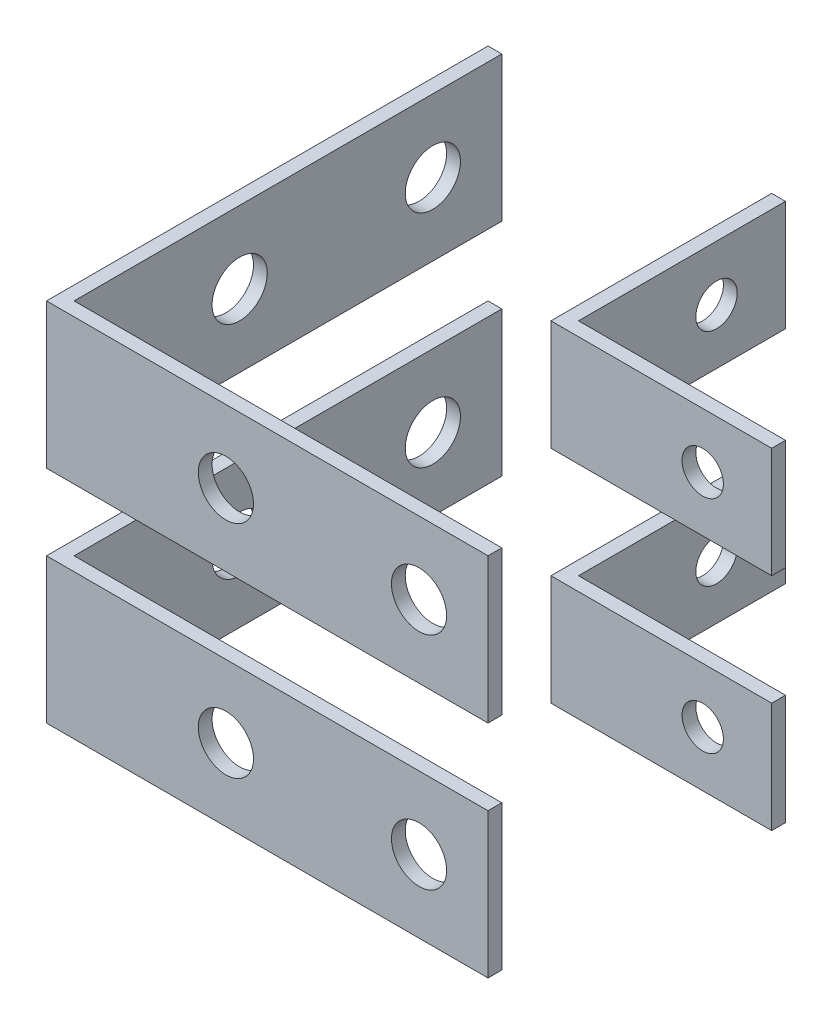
ISO-10303-21;
HEADER;
FILE_DESCRIPTION(('STEP AP214'),'2;1');
FILE_NAME('part.step','',(''),(''),'','','');
FILE_SCHEMA(('AUTOMOTIVE_DESIGN { 1 0 10303 214 1 1 1 1 }'));
ENDSEC;
DATA;
#1=APPLICATION_CONTEXT('core data for automotive mechanical design processes');
#2=APPLICATION_PROTOCOL_DEFINITION('international standard','automotive_design',2000,#1);
#3=PRODUCT_CONTEXT('',#1,'mechanical');
#4=PRODUCT('Part','Part','',(#3));
#5=PRODUCT_RELATED_PRODUCT_CATEGORY('part','',(#4));
#6=PRODUCT_DEFINITION_FORMATION('','',#4);
#7=PRODUCT_DEFINITION_CONTEXT('part definition',#1,'design');
#8=PRODUCT_DEFINITION('design','',#6,#7);
#9=PRODUCT_DEFINITION_SHAPE('','',#8);
#10=(LENGTH_UNIT() NAMED_UNIT(*) SI_UNIT(.MILLI.,.METRE.));
#11=(NAMED_UNIT(*) PLANE_ANGLE_UNIT() SI_UNIT($,.RADIAN.));
#12=(NAMED_UNIT(*) SI_UNIT($,.STERADIAN.) SOLID_ANGLE_UNIT());
#13=UNCERTAINTY_MEASURE_WITH_UNIT(LENGTH_MEASURE(1.E-05),#10,'distance_accuracy_value','');
#14=(GEOMETRIC_REPRESENTATION_CONTEXT(3) GLOBAL_UNCERTAINTY_ASSIGNED_CONTEXT((#13)) GLOBAL_UNIT_ASSIGNED_CONTEXT((#10,
#11,#12)) REPRESENTATION_CONTEXT('',''));
#15=CARTESIAN_POINT('',(0.,0.,0.));
#16=DIRECTION('',(0.,0.,1.));
#17=DIRECTION('',(1.,0.,0.));
#18=AXIS2_PLACEMENT_3D('',#15,#16,#17);
#19=CARTESIAN_POINT('',(27.432,-19.05,-27.432));
#20=DIRECTION('',(0.,0.,1.));
#21=DIRECTION('',(1.,0.,0.));
#22=AXIS2_PLACEMENT_3D('',#19,#20,#21);
#23=PLANE('',#22);
#24=CARTESIAN_POINT('',(44.8945,-12.7,-27.432));
#25=DIRECTION('',(0.,0.,1.));
#26=DIRECTION('',(1.,0.,0.));
#27=AXIS2_PLACEMENT_3D('',#24,#25,#26);
#28=CIRCLE('',#27,2.38125);
#29=CARTESIAN_POINT('',(42.51325,-12.7,-27.432));
#30=VERTEX_POINT('',#29);
#31=EDGE_CURVE('E138',#30,#30,#28,.F.);
#32=ORIENTED_EDGE('',*,*,#31,.T.);
#33=EDGE_LOOP('',(#32));
#34=FACE_BOUND('',#33,.T.);
#35=DIRECTION('',(1.,0.,0.));
#36=VECTOR('',#35,1.);
#37=CARTESIAN_POINT('',(27.432,-6.35,-27.432));
#38=LINE('',#37,#36);
#39=CARTESIAN_POINT('',(27.432,-6.35,-27.432));
#40=VERTEX_POINT('',#39);
#41=CARTESIAN_POINT('',(52.832,-6.35,-27.432));
#42=VERTEX_POINT('',#41);
#43=EDGE_CURVE('E134',#40,#42,#38,.T.);
#44=ORIENTED_EDGE('',*,*,#43,.F.);
#45=DIRECTION('',(0.,1.,0.));
#46=VECTOR('',#45,1.);
#47=CARTESIAN_POINT('',(27.432,-19.05,-27.432));
#48=LINE('',#47,#46);
#49=CARTESIAN_POINT('',(27.432,-19.05,-27.432));
#50=VERTEX_POINT('',#49);
#51=EDGE_CURVE('E12',#50,#40,#48,.T.);
#52=ORIENTED_EDGE('',*,*,#51,.F.);
#53=DIRECTION('',(1.,0.,0.));
#54=VECTOR('',#53,1.);
#55=CARTESIAN_POINT('',(27.432,-19.05,-27.432));
#56=LINE('',#55,#54);
#57=CARTESIAN_POINT('',(52.832,-19.05,-27.432));
#58=VERTEX_POINT('',#57);
#59=EDGE_CURVE('E148',#50,#58,#56,.T.);
#60=ORIENTED_EDGE('',*,*,#59,.T.);
#61=DIRECTION('',(0.,1.,0.));
#62=VECTOR('',#61,1.);
#63=CARTESIAN_POINT('',(52.832,-19.05,-27.432));
#64=LINE('',#63,#62);
#65=EDGE_CURVE('E55',#58,#42,#64,.T.);
#66=ORIENTED_EDGE('',*,*,#65,.T.);
#67=EDGE_LOOP('',(#44,#52,#60,#66));
#68=FACE_BOUND('',#67,.T.);
#69=ADVANCED_FACE('F52',(#34,#68),#23,.T.);
#70=CARTESIAN_POINT('',(27.432,-19.05,-27.432));
#71=DIRECTION('',(-1.,0.,0.));
#72=DIRECTION('',(0.,0.,1.));
#73=AXIS2_PLACEMENT_3D('',#70,#71,#72);
#74=PLANE('',#73);
#75=CARTESIAN_POINT('',(27.432,-12.7,-44.8945));
#76=DIRECTION('',(-1.,0.,0.));
#77=DIRECTION('',(0.,0.,1.));
#78=AXIS2_PLACEMENT_3D('',#75,#76,#77);
#79=CIRCLE('',#78,2.38125);
#80=CARTESIAN_POINT('',(27.432,-12.7,-47.27575));
#81=VERTEX_POINT('',#80);
#82=EDGE_CURVE('E199',#81,#81,#79,.F.);
#83=ORIENTED_EDGE('',*,*,#82,.T.);
#84=EDGE_LOOP('',(#83));
#85=FACE_BOUND('',#84,.T.);
#86=DIRECTION('',(0.,0.,1.));
#87=VECTOR('',#86,1.);
#88=CARTESIAN_POINT('',(27.432,-6.35,-27.432));
#89=LINE('',#88,#87);
#90=CARTESIAN_POINT('',(27.432,-6.35,-52.832));
#91=VERTEX_POINT('',#90);
#92=EDGE_CURVE('E146',#91,#40,#89,.T.);
#93=ORIENTED_EDGE('',*,*,#92,.F.);
#94=DIRECTION('',(0.,1.,0.));
#95=VECTOR('',#94,1.);
#96=CARTESIAN_POINT('',(27.432,-19.05,-52.832));
#97=LINE('',#96,#95);
#98=CARTESIAN_POINT('',(27.432,-19.05,-52.832));
#99=VERTEX_POINT('',#98);
#100=EDGE_CURVE('E61',#99,#91,#97,.T.);
#101=ORIENTED_EDGE('',*,*,#100,.F.);
#102=DIRECTION('',(0.,0.,1.));
#103=VECTOR('',#102,1.);
#104=CARTESIAN_POINT('',(27.432,-19.05,-27.432));
#105=LINE('',#104,#103);
#106=EDGE_CURVE('E115',#99,#50,#105,.T.);
#107=ORIENTED_EDGE('',*,*,#106,.T.);
#108=ORIENTED_EDGE('',*,*,#51,.T.);
#109=EDGE_LOOP('',(#93,#101,#107,#108));
#110=FACE_BOUND('',#109,.T.);
#111=ADVANCED_FACE('F160',(#85,#110),#74,.T.);
#112=CARTESIAN_POINT('',(27.432,-19.05,-52.832));
#113=DIRECTION('',(0.,0.,1.));
#114=DIRECTION('',(1.,0.,0.));
#115=AXIS2_PLACEMENT_3D('',#112,#113,#114);
#116=PLANE('',#115);
#117=DIRECTION('',(1.,0.,0.));
#118=VECTOR('',#117,1.);
#119=CARTESIAN_POINT('',(27.432,-6.35,-52.832));
#120=LINE('',#119,#118);
#121=CARTESIAN_POINT('',(29.0195,-6.35,-52.832));
#122=VERTEX_POINT('',#121);
#123=EDGE_CURVE('E120',#91,#122,#120,.T.);
#124=ORIENTED_EDGE('',*,*,#123,.T.);
#125=DIRECTION('',(0.,1.,0.));
#126=VECTOR('',#125,1.);
#127=CARTESIAN_POINT('',(29.0195,-19.05,-52.832));
#128=LINE('',#127,#126);
#129=CARTESIAN_POINT('',(29.0195,-19.05,-52.832));
#130=VERTEX_POINT('',#129);
#131=EDGE_CURVE('E118',#130,#122,#128,.T.);
#132=ORIENTED_EDGE('',*,*,#131,.F.);
#133=DIRECTION('',(1.,0.,0.));
#134=VECTOR('',#133,1.);
#135=CARTESIAN_POINT('',(27.432,-19.05,-52.832));
#136=LINE('',#135,#134);
#137=EDGE_CURVE('E109',#99,#130,#136,.T.);
#138=ORIENTED_EDGE('',*,*,#137,.F.);
#139=ORIENTED_EDGE('',*,*,#100,.T.);
#140=EDGE_LOOP('',(#124,#132,#138,#139));
#141=FACE_BOUND('',#140,.T.);
#142=ADVANCED_FACE('F119',(#141),#116,.F.);
#143=CARTESIAN_POINT('',(29.0195,-19.05,-27.432));
#144=DIRECTION('',(-1.,0.,0.));
#145=DIRECTION('',(0.,0.,1.));
#146=AXIS2_PLACEMENT_3D('',#143,#144,#145);
#147=PLANE('',#146);
#148=CARTESIAN_POINT('',(29.0195,-12.7,-44.8945));
#149=DIRECTION('',(1.,0.,0.));
#150=DIRECTION('',(0.,0.,-1.));
#151=AXIS2_PLACEMENT_3D('',#148,#149,#150);
#152=CIRCLE('',#151,2.38125);
#153=CARTESIAN_POINT('',(29.0195,-12.7,-47.27575));
#154=VERTEX_POINT('',#153);
#155=EDGE_CURVE('E202',#154,#154,#152,.T.);
#156=ORIENTED_EDGE('',*,*,#155,.F.);
#157=EDGE_LOOP('',(#156));
#158=FACE_BOUND('',#157,.T.);
#159=DIRECTION('',(0.,0.,-1.));
#160=VECTOR('',#159,1.);
#161=CARTESIAN_POINT('',(29.0195,-6.35,-27.432));
#162=LINE('',#161,#160);
#163=CARTESIAN_POINT('',(29.0195,-6.35,-29.0195));
#164=VERTEX_POINT('',#163);
#165=EDGE_CURVE('E143',#122,#164,#162,.F.);
#166=ORIENTED_EDGE('',*,*,#165,.T.);
#167=DIRECTION('',(0.,1.,0.));
#168=VECTOR('',#167,1.);
#169=CARTESIAN_POINT('',(29.0195,-19.05,-29.0195));
#170=LINE('',#169,#168);
#171=CARTESIAN_POINT('',(29.0195,-19.05,-29.0195));
#172=VERTEX_POINT('',#171);
#173=EDGE_CURVE('E123',#172,#164,#170,.T.);
#174=ORIENTED_EDGE('',*,*,#173,.F.);
#175=DIRECTION('',(0.,0.,-1.));
#176=VECTOR('',#175,1.);
#177=CARTESIAN_POINT('',(29.0195,-19.05,-27.432));
#178=LINE('',#177,#176);
#179=EDGE_CURVE('E113',#130,#172,#178,.F.);
#180=ORIENTED_EDGE('',*,*,#179,.F.);
#181=ORIENTED_EDGE('',*,*,#131,.T.);
#182=EDGE_LOOP('',(#166,#174,#180,#181));
#183=FACE_BOUND('',#182,.T.);
#184=ADVANCED_FACE('F125',(#158,#183),#147,.F.);
#185=CARTESIAN_POINT('',(27.432,-19.05,-29.0195));
#186=DIRECTION('',(0.,0.,1.));
#187=DIRECTION('',(1.,0.,0.));
#188=AXIS2_PLACEMENT_3D('',#185,#186,#187);
#189=PLANE('',#188);
#190=CARTESIAN_POINT('',(44.8945,-12.7,-29.0195));
#191=DIRECTION('',(0.,0.,-1.));
#192=DIRECTION('',(-1.,0.,0.));
#193=AXIS2_PLACEMENT_3D('',#190,#191,#192);
#194=CIRCLE('',#193,2.38125);
#195=CARTESIAN_POINT('',(42.51325,-12.7,-29.0195));
#196=VERTEX_POINT('',#195);
#197=EDGE_CURVE('E204',#196,#196,#194,.T.);
#198=ORIENTED_EDGE('',*,*,#197,.F.);
#199=EDGE_LOOP('',(#198));
#200=FACE_BOUND('',#199,.T.);
#201=DIRECTION('',(1.,0.,0.));
#202=VECTOR('',#201,1.);
#203=CARTESIAN_POINT('',(27.432,-6.35,-29.0195));
#204=LINE('',#203,#202);
#205=CARTESIAN_POINT('',(52.832,-6.35,-29.0195));
#206=VERTEX_POINT('',#205);
#207=EDGE_CURVE('E141',#164,#206,#204,.T.);
#208=ORIENTED_EDGE('',*,*,#207,.T.);
#209=DIRECTION('',(0.,1.,0.));
#210=VECTOR('',#209,1.);
#211=CARTESIAN_POINT('',(52.832,-19.05,-29.0195));
#212=LINE('',#211,#210);
#213=CARTESIAN_POINT('',(52.832,-19.05,-29.0195));
#214=VERTEX_POINT('',#213);
#215=EDGE_CURVE('E151',#214,#206,#212,.T.);
#216=ORIENTED_EDGE('',*,*,#215,.F.);
#217=DIRECTION('',(1.,0.,0.));
#218=VECTOR('',#217,1.);
#219=CARTESIAN_POINT('',(27.432,-19.05,-29.0195));
#220=LINE('',#219,#218);
#221=EDGE_CURVE('E128',#172,#214,#220,.T.);
#222=ORIENTED_EDGE('',*,*,#221,.F.);
#223=ORIENTED_EDGE('',*,*,#173,.T.);
#224=EDGE_LOOP('',(#208,#216,#222,#223));
#225=FACE_BOUND('',#224,.T.);
#226=ADVANCED_FACE('F177',(#200,#225),#189,.F.);
#227=CARTESIAN_POINT('',(52.832,-19.05,-29.0195));
#228=DIRECTION('',(-1.,0.,0.));
#229=DIRECTION('',(0.,0.,1.));
#230=AXIS2_PLACEMENT_3D('',#227,#228,#229);
#231=PLANE('',#230);
#232=DIRECTION('',(0.,0.,1.));
#233=VECTOR('',#232,1.);
#234=CARTESIAN_POINT('',(52.832,-6.35,-29.0195));
#235=LINE('',#234,#233);
#236=EDGE_CURVE('E137',#206,#42,#235,.T.);
#237=ORIENTED_EDGE('',*,*,#236,.T.);
#238=ORIENTED_EDGE('',*,*,#65,.F.);
#239=DIRECTION('',(0.,0.,1.));
#240=VECTOR('',#239,1.);
#241=CARTESIAN_POINT('',(52.832,-19.05,-29.0195));
#242=LINE('',#241,#240);
#243=EDGE_CURVE('E101',#214,#58,#242,.T.);
#244=ORIENTED_EDGE('',*,*,#243,.F.);
#245=ORIENTED_EDGE('',*,*,#215,.T.);
#246=EDGE_LOOP('',(#237,#238,#244,#245));
#247=FACE_BOUND('',#246,.T.);
#248=ADVANCED_FACE('F156',(#247),#231,.F.);
#249=CARTESIAN_POINT('',(0.,-19.05,0.));
#250=DIRECTION('',(0.,-1.,0.));
#251=DIRECTION('',(-1.,0.,0.));
#252=AXIS2_PLACEMENT_3D('',#249,#250,#251);
#253=PLANE('',#252);
#254=ORIENTED_EDGE('',*,*,#59,.F.);
#255=ORIENTED_EDGE('',*,*,#106,.F.);
#256=ORIENTED_EDGE('',*,*,#137,.T.);
#257=ORIENTED_EDGE('',*,*,#179,.T.);
#258=ORIENTED_EDGE('',*,*,#221,.T.);
#259=ORIENTED_EDGE('',*,*,#243,.T.);
#260=EDGE_LOOP('',(#254,#255,#256,#257,#258,#259));
#261=FACE_BOUND('',#260,.T.);
#262=ADVANCED_FACE('F111',(#261),#253,.T.);
#263=CARTESIAN_POINT('',(0.,-6.35,0.));
#264=DIRECTION('',(0.,-1.,0.));
#265=DIRECTION('',(-1.,0.,0.));
#266=AXIS2_PLACEMENT_3D('',#263,#264,#265);
#267=PLANE('',#266);
#268=ORIENTED_EDGE('',*,*,#43,.T.);
#269=ORIENTED_EDGE('',*,*,#236,.F.);
#270=ORIENTED_EDGE('',*,*,#207,.F.);
#271=ORIENTED_EDGE('',*,*,#165,.F.);
#272=ORIENTED_EDGE('',*,*,#123,.F.);
#273=ORIENTED_EDGE('',*,*,#92,.T.);
#274=EDGE_LOOP('',(#268,#269,#270,#271,#272,#273));
#275=FACE_BOUND('',#274,.T.);
#276=ADVANCED_FACE('F159',(#275),#267,.F.);
#277=CARTESIAN_POINT('',(44.8945,-12.7,1.5885));
#278=DIRECTION('',(0.,0.,-1.));
#279=DIRECTION('',(-1.,0.,0.));
#280=AXIS2_PLACEMENT_3D('',#277,#278,#279);
#281=CYLINDRICAL_SURFACE('',#280,2.38125);
#282=CARTESIAN_POINT('',(42.51325,-12.7,-27.432));
#283=CARTESIAN_POINT('',(42.51325,-12.7,-27.4485364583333));
#284=CARTESIAN_POINT('',(42.51325,-12.7,-27.4650729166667));
#285=CARTESIAN_POINT('',(42.51325,-12.7,-27.4981458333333));
#286=CARTESIAN_POINT('',(42.51325,-12.7,-27.5146822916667));
#287=CARTESIAN_POINT('',(42.51325,-12.7,-27.5477552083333));
#288=CARTESIAN_POINT('',(42.51325,-12.7,-27.5642916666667));
#289=CARTESIAN_POINT('',(42.51325,-12.7,-27.5973645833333));
#290=CARTESIAN_POINT('',(42.51325,-12.7,-27.6139010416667));
#291=CARTESIAN_POINT('',(42.51325,-12.7,-27.6469739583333));
#292=CARTESIAN_POINT('',(42.51325,-12.7,-27.6635104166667));
#293=CARTESIAN_POINT('',(42.51325,-12.7,-27.6965833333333));
#294=CARTESIAN_POINT('',(42.51325,-12.7,-27.7131197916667));
#295=CARTESIAN_POINT('',(42.51325,-12.7,-27.7461927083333));
#296=CARTESIAN_POINT('',(42.51325,-12.7,-27.7627291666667));
#297=CARTESIAN_POINT('',(42.51325,-12.7,-27.7958020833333));
#298=CARTESIAN_POINT('',(42.51325,-12.7,-27.8123385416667));
#299=CARTESIAN_POINT('',(42.51325,-12.7,-27.8454114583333));
#300=CARTESIAN_POINT('',(42.51325,-12.7,-27.8619479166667));
#301=CARTESIAN_POINT('',(42.51325,-12.7,-27.8950208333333));
#302=CARTESIAN_POINT('',(42.51325,-12.7,-27.9115572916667));
#303=CARTESIAN_POINT('',(42.51325,-12.7,-27.9446302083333));
#304=CARTESIAN_POINT('',(42.51325,-12.7,-27.9611666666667));
#305=CARTESIAN_POINT('',(42.51325,-12.7,-27.9942395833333));
#306=CARTESIAN_POINT('',(42.51325,-12.7,-28.0107760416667));
#307=CARTESIAN_POINT('',(42.51325,-12.7,-28.0438489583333));
#308=CARTESIAN_POINT('',(42.51325,-12.7,-28.0603854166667));
#309=CARTESIAN_POINT('',(42.51325,-12.7,-28.0934583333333));
#310=CARTESIAN_POINT('',(42.51325,-12.7,-28.1099947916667));
#311=CARTESIAN_POINT('',(42.51325,-12.7,-28.1430677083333));
#312=CARTESIAN_POINT('',(42.51325,-12.7,-28.1596041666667));
#313=CARTESIAN_POINT('',(42.51325,-12.7,-28.1926770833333));
#314=CARTESIAN_POINT('',(42.51325,-12.7,-28.2092135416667));
#315=CARTESIAN_POINT('',(42.51325,-12.7,-28.2422864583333));
#316=CARTESIAN_POINT('',(42.51325,-12.7,-28.2588229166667));
#317=CARTESIAN_POINT('',(42.51325,-12.7,-28.2918958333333));
#318=CARTESIAN_POINT('',(42.51325,-12.7,-28.3084322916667));
#319=CARTESIAN_POINT('',(42.51325,-12.7,-28.3415052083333));
#320=CARTESIAN_POINT('',(42.51325,-12.7,-28.3580416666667));
#321=CARTESIAN_POINT('',(42.51325,-12.7,-28.3911145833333));
#322=CARTESIAN_POINT('',(42.51325,-12.7,-28.4076510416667));
#323=CARTESIAN_POINT('',(42.51325,-12.7,-28.4407239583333));
#324=CARTESIAN_POINT('',(42.51325,-12.7,-28.4572604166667));
#325=CARTESIAN_POINT('',(42.51325,-12.7,-28.4903333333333));
#326=CARTESIAN_POINT('',(42.51325,-12.7,-28.5068697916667));
#327=CARTESIAN_POINT('',(42.51325,-12.7,-28.5399427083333));
#328=CARTESIAN_POINT('',(42.51325,-12.7,-28.5564791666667));
#329=CARTESIAN_POINT('',(42.51325,-12.7,-28.5895520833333));
#330=CARTESIAN_POINT('',(42.51325,-12.7,-28.6060885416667));
#331=CARTESIAN_POINT('',(42.51325,-12.7,-28.6391614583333));
#332=CARTESIAN_POINT('',(42.51325,-12.7,-28.6556979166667));
#333=CARTESIAN_POINT('',(42.51325,-12.7,-28.6887708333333));
#334=CARTESIAN_POINT('',(42.51325,-12.7,-28.7053072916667));
#335=CARTESIAN_POINT('',(42.51325,-12.7,-28.7383802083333));
#336=CARTESIAN_POINT('',(42.51325,-12.7,-28.7549166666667));
#337=CARTESIAN_POINT('',(42.51325,-12.7,-28.7879895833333));
#338=CARTESIAN_POINT('',(42.51325,-12.7,-28.8045260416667));
#339=CARTESIAN_POINT('',(42.51325,-12.7,-28.8375989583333));
#340=CARTESIAN_POINT('',(42.51325,-12.7,-28.8541354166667));
#341=CARTESIAN_POINT('',(42.51325,-12.7,-28.8872083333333));
#342=CARTESIAN_POINT('',(42.51325,-12.7,-28.9037447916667));
#343=CARTESIAN_POINT('',(42.51325,-12.7,-28.9368177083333));
#344=CARTESIAN_POINT('',(42.51325,-12.7,-28.9533541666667));
#345=CARTESIAN_POINT('',(42.51325,-12.7,-28.9864270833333));
#346=CARTESIAN_POINT('',(42.51325,-12.7,-29.0029635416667));
#347=CARTESIAN_POINT('',(42.51325,-12.7,-29.0195));
#348=B_SPLINE_CURVE_WITH_KNOTS('',3,(#282,#283,#284,#285,#286,#287,#288,#289,#290,#291,#292,
#293,#294,#295,#296,#297,#298,#299,#300,#301,#302,#303,#304,#305,#306,#307,#308,#309,#310,#311,
#312,#313,#314,#315,#316,#317,#318,#319,#320,#321,#322,#323,#324,#325,#326,#327,#328,#329,#330,
#331,#332,#333,#334,#335,#336,#337,#338,#339,#340,#341,#342,#343,#344,#345,#346,#347),
.UNSPECIFIED.,.F.,.F.,(4,2,2,2,2,2,2,2,2,2,2,2,2,2,2,2,2,2,2,2,2,2,2,2,2,2,2,2,2,2,2,2,4),(0.,
0.0496093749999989,0.0992187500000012,0.148828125,0.198437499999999,0.248046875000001,
0.29765625,0.347265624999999,0.396874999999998,0.446484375,0.496093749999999,0.545703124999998,
0.5953125,0.644921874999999,0.694531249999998,0.744140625,0.793749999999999,0.843359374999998,
0.892968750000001,0.942578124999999,0.992187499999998,1.041796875,1.09140625,1.141015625,
1.190625,1.240234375,1.28984375,1.339453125,1.3890625,1.438671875,1.48828125,1.537890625,
1.5875),.UNSPECIFIED.);
#349=EDGE_CURVE('BSEAM188',#30,#196,#348,.T.);
#350=ORIENTED_EDGE('',*,*,#31,.F.);
#351=ORIENTED_EDGE('',*,*,#197,.T.);
#352=ORIENTED_EDGE('',*,*,#349,.T.);
#353=ORIENTED_EDGE('',*,*,#349,.F.);
#354=EDGE_LOOP('',(#350,#352,#351,#353));
#355=FACE_BOUND('',#354,.T.);
#356=ADVANCED_FACE('F188',(#355),#281,.F.);
#357=CARTESIAN_POINT('',(-1.5885,-12.7,-44.8945));
#358=DIRECTION('',(1.,0.,0.));
#359=DIRECTION('',(0.,0.,-1.));
#360=AXIS2_PLACEMENT_3D('',#357,#358,#359);
#361=CYLINDRICAL_SURFACE('',#360,2.38125);
#362=CARTESIAN_POINT('',(27.432,-12.7,-47.27575));
#363=CARTESIAN_POINT('',(27.4485364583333,-12.7,-47.27575));
#364=CARTESIAN_POINT('',(27.4650729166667,-12.7,-47.27575));
#365=CARTESIAN_POINT('',(27.4981458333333,-12.7,-47.27575));
#366=CARTESIAN_POINT('',(27.5146822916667,-12.7,-47.27575));
#367=CARTESIAN_POINT('',(27.5477552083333,-12.7,-47.27575));
#368=CARTESIAN_POINT('',(27.5642916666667,-12.7,-47.27575));
#369=CARTESIAN_POINT('',(27.5973645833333,-12.7,-47.27575));
#370=CARTESIAN_POINT('',(27.6139010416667,-12.7,-47.27575));
#371=CARTESIAN_POINT('',(27.6469739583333,-12.7,-47.27575));
#372=CARTESIAN_POINT('',(27.6635104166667,-12.7,-47.27575));
#373=CARTESIAN_POINT('',(27.6965833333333,-12.7,-47.27575));
#374=CARTESIAN_POINT('',(27.7131197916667,-12.7,-47.27575));
#375=CARTESIAN_POINT('',(27.7461927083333,-12.7,-47.27575));
#376=CARTESIAN_POINT('',(27.7627291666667,-12.7,-47.27575));
#377=CARTESIAN_POINT('',(27.7958020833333,-12.7,-47.27575));
#378=CARTESIAN_POINT('',(27.8123385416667,-12.7,-47.27575));
#379=CARTESIAN_POINT('',(27.8454114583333,-12.7,-47.27575));
#380=CARTESIAN_POINT('',(27.8619479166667,-12.7,-47.27575));
#381=CARTESIAN_POINT('',(27.8950208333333,-12.7,-47.27575));
#382=CARTESIAN_POINT('',(27.9115572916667,-12.7,-47.27575));
#383=CARTESIAN_POINT('',(27.9446302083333,-12.7,-47.27575));
#384=CARTESIAN_POINT('',(27.9611666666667,-12.7,-47.27575));
#385=CARTESIAN_POINT('',(27.9942395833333,-12.7,-47.27575));
#386=CARTESIAN_POINT('',(28.0107760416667,-12.7,-47.27575));
#387=CARTESIAN_POINT('',(28.0438489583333,-12.7,-47.27575));
#388=CARTESIAN_POINT('',(28.0603854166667,-12.7,-47.27575));
#389=CARTESIAN_POINT('',(28.0934583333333,-12.7,-47.27575));
#390=CARTESIAN_POINT('',(28.1099947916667,-12.7,-47.27575));
#391=CARTESIAN_POINT('',(28.1430677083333,-12.7,-47.27575));
#392=CARTESIAN_POINT('',(28.1596041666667,-12.7,-47.27575));
#393=CARTESIAN_POINT('',(28.1926770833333,-12.7,-47.27575));
#394=CARTESIAN_POINT('',(28.2092135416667,-12.7,-47.27575));
#395=CARTESIAN_POINT('',(28.2422864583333,-12.7,-47.27575));
#396=CARTESIAN_POINT('',(28.2588229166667,-12.7,-47.27575));
#397=CARTESIAN_POINT('',(28.2918958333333,-12.7,-47.27575));
#398=CARTESIAN_POINT('',(28.3084322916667,-12.7,-47.27575));
#399=CARTESIAN_POINT('',(28.3415052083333,-12.7,-47.27575));
#400=CARTESIAN_POINT('',(28.3580416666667,-12.7,-47.27575));
#401=CARTESIAN_POINT('',(28.3911145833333,-12.7,-47.27575));
#402=CARTESIAN_POINT('',(28.4076510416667,-12.7,-47.27575));
#403=CARTESIAN_POINT('',(28.4407239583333,-12.7,-47.27575));
#404=CARTESIAN_POINT('',(28.4572604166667,-12.7,-47.27575));
#405=CARTESIAN_POINT('',(28.4903333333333,-12.7,-47.27575));
#406=CARTESIAN_POINT('',(28.5068697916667,-12.7,-47.27575));
#407=CARTESIAN_POINT('',(28.5399427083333,-12.7,-47.27575));
#408=CARTESIAN_POINT('',(28.5564791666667,-12.7,-47.27575));
#409=CARTESIAN_POINT('',(28.5895520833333,-12.7,-47.27575));
#410=CARTESIAN_POINT('',(28.6060885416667,-12.7,-47.27575));
#411=CARTESIAN_POINT('',(28.6391614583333,-12.7,-47.27575));
#412=CARTESIAN_POINT('',(28.6556979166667,-12.7,-47.27575));
#413=CARTESIAN_POINT('',(28.6887708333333,-12.7,-47.27575));
#414=CARTESIAN_POINT('',(28.7053072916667,-12.7,-47.27575));
#415=CARTESIAN_POINT('',(28.7383802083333,-12.7,-47.27575));
#416=CARTESIAN_POINT('',(28.7549166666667,-12.7,-47.27575));
#417=CARTESIAN_POINT('',(28.7879895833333,-12.7,-47.27575));
#418=CARTESIAN_POINT('',(28.8045260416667,-12.7,-47.27575));
#419=CARTESIAN_POINT('',(28.8375989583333,-12.7,-47.27575));
#420=CARTESIAN_POINT('',(28.8541354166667,-12.7,-47.27575));
#421=CARTESIAN_POINT('',(28.8872083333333,-12.7,-47.27575));
#422=CARTESIAN_POINT('',(28.9037447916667,-12.7,-47.27575));
#423=CARTESIAN_POINT('',(28.9368177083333,-12.7,-47.27575));
#424=CARTESIAN_POINT('',(28.9533541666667,-12.7,-47.27575));
#425=CARTESIAN_POINT('',(28.9864270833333,-12.7,-47.27575));
#426=CARTESIAN_POINT('',(29.0029635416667,-12.7,-47.27575));
#427=CARTESIAN_POINT('',(29.0195,-12.7,-47.27575));
#428=B_SPLINE_CURVE_WITH_KNOTS('',3,(#362,#363,#364,#365,#366,#367,#368,#369,#370,#371,#372,
#373,#374,#375,#376,#377,#378,#379,#380,#381,#382,#383,#384,#385,#386,#387,#388,#389,#390,#391,
#392,#393,#394,#395,#396,#397,#398,#399,#400,#401,#402,#403,#404,#405,#406,#407,#408,#409,#410,
#411,#412,#413,#414,#415,#416,#417,#418,#419,#420,#421,#422,#423,#424,#425,#426,#427),
.UNSPECIFIED.,.F.,.F.,(4,2,2,2,2,2,2,2,2,2,2,2,2,2,2,2,2,2,2,2,2,2,2,2,2,2,2,2,2,2,2,2,4),(0.,
0.0496093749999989,0.0992187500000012,0.148828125,0.198437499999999,0.248046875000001,
0.29765625,0.347265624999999,0.396874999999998,0.446484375,0.496093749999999,0.545703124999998,
0.5953125,0.644921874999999,0.694531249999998,0.744140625,0.793749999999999,0.843359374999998,
0.892968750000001,0.942578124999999,0.992187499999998,1.041796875,1.09140625,1.141015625,
1.190625,1.240234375,1.28984375,1.339453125,1.3890625,1.438671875,1.48828125,1.537890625,
1.5875),.UNSPECIFIED.);
#429=EDGE_CURVE('BSEAM191',#81,#154,#428,.T.);
#430=ORIENTED_EDGE('',*,*,#82,.F.);
#431=ORIENTED_EDGE('',*,*,#155,.T.);
#432=ORIENTED_EDGE('',*,*,#429,.T.);
#433=ORIENTED_EDGE('',*,*,#429,.F.);
#434=EDGE_LOOP('',(#430,#432,#431,#433));
#435=FACE_BOUND('',#434,.T.);
#436=ADVANCED_FACE('F191',(#435),#361,.F.);
#437=CLOSED_SHELL('',(#69,#111,#142,#184,#226,#248,#262,#276,#356,#436));
#438=MANIFOLD_SOLID_BREP('B2',#437);
#439=CARTESIAN_POINT('',(27.432,19.05,-27.432));
#440=DIRECTION('',(0.,0.,-1.));
#441=DIRECTION('',(-1.,0.,0.));
#442=AXIS2_PLACEMENT_3D('',#439,#440,#441);
#443=PLANE('',#442);
#444=CARTESIAN_POINT('',(44.8945,12.7,-27.432));
#445=DIRECTION('',(0.,0.,-1.));
#446=DIRECTION('',(-1.,0.,0.));
#447=AXIS2_PLACEMENT_3D('',#444,#445,#446);
#448=CIRCLE('',#447,2.38125);
#449=CARTESIAN_POINT('',(42.51325,12.7,-27.432));
#450=VERTEX_POINT('',#449);
#451=EDGE_CURVE('E365',#450,#450,#448,.F.);
#452=ORIENTED_EDGE('',*,*,#451,.F.);
#453=EDGE_LOOP('',(#452));
#454=FACE_BOUND('',#453,.T.);
#455=DIRECTION('',(1.,0.,0.));
#456=VECTOR('',#455,1.);
#457=CARTESIAN_POINT('',(27.432,6.35,-27.432));
#458=LINE('',#457,#456);
#459=CARTESIAN_POINT('',(27.432,6.35,-27.432));
#460=VERTEX_POINT('',#459);
#461=CARTESIAN_POINT('',(52.832,6.35,-27.432));
#462=VERTEX_POINT('',#461);
#463=EDGE_CURVE('E361',#460,#462,#458,.T.);
#464=ORIENTED_EDGE('',*,*,#463,.T.);
#465=DIRECTION('',(0.,-1.,0.));
#466=VECTOR('',#465,1.);
#467=CARTESIAN_POINT('',(52.832,19.05,-27.432));
#468=LINE('',#467,#466);
#469=CARTESIAN_POINT('',(52.832,19.05,-27.432));
#470=VERTEX_POINT('',#469);
#471=EDGE_CURVE('E50',#470,#462,#468,.T.);
#472=ORIENTED_EDGE('',*,*,#471,.F.);
#473=DIRECTION('',(1.,0.,0.));
#474=VECTOR('',#473,1.);
#475=CARTESIAN_POINT('',(27.432,19.05,-27.432));
#476=LINE('',#475,#474);
#477=CARTESIAN_POINT('',(27.432,19.05,-27.432));
#478=VERTEX_POINT('',#477);
#479=EDGE_CURVE('E326',#478,#470,#476,.T.);
#480=ORIENTED_EDGE('',*,*,#479,.F.);
#481=DIRECTION('',(0.,-1.,0.));
#482=VECTOR('',#481,1.);
#483=CARTESIAN_POINT('',(27.432,19.05,-27.432));
#484=LINE('',#483,#482);
#485=EDGE_CURVE('E357',#478,#460,#484,.T.);
#486=ORIENTED_EDGE('',*,*,#485,.T.);
#487=EDGE_LOOP('',(#464,#472,#480,#486));
#488=FACE_BOUND('',#487,.T.);
#489=ADVANCED_FACE('F280',(#454,#488),#443,.F.);
#490=CARTESIAN_POINT('',(52.832,19.05,-29.0195));
#491=DIRECTION('',(1.,0.,0.));
#492=DIRECTION('',(0.,0.,-1.));
#493=AXIS2_PLACEMENT_3D('',#490,#491,#492);
#494=PLANE('',#493);
#495=DIRECTION('',(0.,0.,1.));
#496=VECTOR('',#495,1.);
#497=CARTESIAN_POINT('',(52.832,6.35,-29.0195));
#498=LINE('',#497,#496);
#499=CARTESIAN_POINT('',(52.832,6.35,-29.0195));
#500=VERTEX_POINT('',#499);
#501=EDGE_CURVE('E364',#500,#462,#498,.T.);
#502=ORIENTED_EDGE('',*,*,#501,.F.);
#503=DIRECTION('',(0.,-1.,0.));
#504=VECTOR('',#503,1.);
#505=CARTESIAN_POINT('',(52.832,19.05,-29.0195));
#506=LINE('',#505,#504);
#507=CARTESIAN_POINT('',(52.832,19.05,-29.0195));
#508=VERTEX_POINT('',#507);
#509=EDGE_CURVE('E288',#508,#500,#506,.T.);
#510=ORIENTED_EDGE('',*,*,#509,.F.);
#511=DIRECTION('',(0.,0.,1.));
#512=VECTOR('',#511,1.);
#513=CARTESIAN_POINT('',(52.832,19.05,-29.0195));
#514=LINE('',#513,#512);
#515=EDGE_CURVE('E420',#508,#470,#514,.T.);
#516=ORIENTED_EDGE('',*,*,#515,.T.);
#517=ORIENTED_EDGE('',*,*,#471,.T.);
#518=EDGE_LOOP('',(#502,#510,#516,#517));
#519=FACE_BOUND('',#518,.T.);
#520=ADVANCED_FACE('F383',(#519),#494,.T.);
#521=CARTESIAN_POINT('',(27.432,19.05,-29.0195));
#522=DIRECTION('',(0.,0.,-1.));
#523=DIRECTION('',(-1.,0.,0.));
#524=AXIS2_PLACEMENT_3D('',#521,#522,#523);
#525=PLANE('',#524);
#526=CARTESIAN_POINT('',(44.8945,12.7,-29.0195));
#527=DIRECTION('',(0.,0.,-1.));
#528=DIRECTION('',(-1.,0.,0.));
#529=AXIS2_PLACEMENT_3D('',#526,#527,#528);
#530=CIRCLE('',#529,2.38125);
#531=CARTESIAN_POINT('',(42.51325,12.7,-29.0195));
#532=VERTEX_POINT('',#531);
#533=EDGE_CURVE('E412',#532,#532,#530,.T.);
#534=ORIENTED_EDGE('',*,*,#533,.F.);
#535=EDGE_LOOP('',(#534));
#536=FACE_BOUND('',#535,.T.);
#537=DIRECTION('',(1.,0.,0.));
#538=VECTOR('',#537,1.);
#539=CARTESIAN_POINT('',(27.432,6.35,-29.0195));
#540=LINE('',#539,#538);
#541=CARTESIAN_POINT('',(29.0195,6.35,-29.0195));
#542=VERTEX_POINT('',#541);
#543=EDGE_CURVE('E368',#542,#500,#540,.T.);
#544=ORIENTED_EDGE('',*,*,#543,.F.);
#545=DIRECTION('',(0.,-1.,0.));
#546=VECTOR('',#545,1.);
#547=CARTESIAN_POINT('',(29.0195,19.05,-29.0195));
#548=LINE('',#547,#546);
#549=CARTESIAN_POINT('',(29.0195,19.05,-29.0195));
#550=VERTEX_POINT('',#549);
#551=EDGE_CURVE('E347',#550,#542,#548,.T.);
#552=ORIENTED_EDGE('',*,*,#551,.F.);
#553=DIRECTION('',(1.,0.,0.));
#554=VECTOR('',#553,1.);
#555=CARTESIAN_POINT('',(27.432,19.05,-29.0195));
#556=LINE('',#555,#554);
#557=EDGE_CURVE('E353',#550,#508,#556,.T.);
#558=ORIENTED_EDGE('',*,*,#557,.T.);
#559=ORIENTED_EDGE('',*,*,#509,.T.);
#560=EDGE_LOOP('',(#544,#552,#558,#559));
#561=FACE_BOUND('',#560,.T.);
#562=ADVANCED_FACE('F380',(#536,#561),#525,.T.);
#563=CARTESIAN_POINT('',(29.0195,19.05,-27.432));
#564=DIRECTION('',(1.,0.,0.));
#565=DIRECTION('',(0.,0.,-1.));
#566=AXIS2_PLACEMENT_3D('',#563,#564,#565);
#567=PLANE('',#566);
#568=CARTESIAN_POINT('',(29.0195,12.7,-44.8945));
#569=DIRECTION('',(1.,0.,0.));
#570=DIRECTION('',(0.,0.,-1.));
#571=AXIS2_PLACEMENT_3D('',#568,#569,#570);
#572=CIRCLE('',#571,2.38125);
#573=CARTESIAN_POINT('',(29.0195,12.7,-47.27575));
#574=VERTEX_POINT('',#573);
#575=EDGE_CURVE('E423',#574,#574,#572,.T.);
#576=ORIENTED_EDGE('',*,*,#575,.F.);
#577=EDGE_LOOP('',(#576));
#578=FACE_BOUND('',#577,.T.);
#579=DIRECTION('',(0.,0.,-1.));
#580=VECTOR('',#579,1.);
#581=CARTESIAN_POINT('',(29.0195,6.35,-27.432));
#582=LINE('',#581,#580);
#583=CARTESIAN_POINT('',(29.0195,6.35,-52.832));
#584=VERTEX_POINT('',#583);
#585=EDGE_CURVE('E342',#584,#542,#582,.F.);
#586=ORIENTED_EDGE('',*,*,#585,.F.);
#587=DIRECTION('',(0.,-1.,0.));
#588=VECTOR('',#587,1.);
#589=CARTESIAN_POINT('',(29.0195,19.05,-52.832));
#590=LINE('',#589,#588);
#591=CARTESIAN_POINT('',(29.0195,19.05,-52.832));
#592=VERTEX_POINT('',#591);
#593=EDGE_CURVE('E337',#592,#584,#590,.T.);
#594=ORIENTED_EDGE('',*,*,#593,.F.);
#595=DIRECTION('',(0.,0.,-1.));
#596=VECTOR('',#595,1.);
#597=CARTESIAN_POINT('',(29.0195,19.05,-27.432));
#598=LINE('',#597,#596);
#599=EDGE_CURVE('E340',#592,#550,#598,.F.);
#600=ORIENTED_EDGE('',*,*,#599,.T.);
#601=ORIENTED_EDGE('',*,*,#551,.T.);
#602=EDGE_LOOP('',(#586,#594,#600,#601));
#603=FACE_BOUND('',#602,.T.);
#604=ADVANCED_FACE('F339',(#578,#603),#567,.T.);
#605=CARTESIAN_POINT('',(27.432,19.05,-52.832));
#606=DIRECTION('',(0.,0.,-1.));
#607=DIRECTION('',(-1.,0.,0.));
#608=AXIS2_PLACEMENT_3D('',#605,#606,#607);
#609=PLANE('',#608);
#610=DIRECTION('',(1.,0.,0.));
#611=VECTOR('',#610,1.);
#612=CARTESIAN_POINT('',(27.432,6.35,-52.832));
#613=LINE('',#612,#611);
#614=CARTESIAN_POINT('',(27.432,6.35,-52.832));
#615=VERTEX_POINT('',#614);
#616=EDGE_CURVE('E372',#615,#584,#613,.T.);
#617=ORIENTED_EDGE('',*,*,#616,.F.);
#618=DIRECTION('',(0.,-1.,0.));
#619=VECTOR('',#618,1.);
#620=CARTESIAN_POINT('',(27.432,19.05,-52.832));
#621=LINE('',#620,#619);
#622=CARTESIAN_POINT('',(27.432,19.05,-52.832));
#623=VERTEX_POINT('',#622);
#624=EDGE_CURVE('E317',#623,#615,#621,.T.);
#625=ORIENTED_EDGE('',*,*,#624,.F.);
#626=DIRECTION('',(1.,0.,0.));
#627=VECTOR('',#626,1.);
#628=CARTESIAN_POINT('',(27.432,19.05,-52.832));
#629=LINE('',#628,#627);
#630=EDGE_CURVE('E351',#623,#592,#629,.T.);
#631=ORIENTED_EDGE('',*,*,#630,.T.);
#632=ORIENTED_EDGE('',*,*,#593,.T.);
#633=EDGE_LOOP('',(#617,#625,#631,#632));
#634=FACE_BOUND('',#633,.T.);
#635=ADVANCED_FACE('F355',(#634),#609,.T.);
#636=CARTESIAN_POINT('',(27.432,19.05,-27.432));
#637=DIRECTION('',(1.,0.,0.));
#638=DIRECTION('',(0.,0.,-1.));
#639=AXIS2_PLACEMENT_3D('',#636,#637,#638);
#640=PLANE('',#639);
#641=CARTESIAN_POINT('',(27.432,12.7,-44.8945));
#642=DIRECTION('',(1.,0.,0.));
#643=DIRECTION('',(0.,0.,-1.));
#644=AXIS2_PLACEMENT_3D('',#641,#642,#643);
#645=CIRCLE('',#644,2.38125);
#646=CARTESIAN_POINT('',(27.432,12.7,-47.27575));
#647=VERTEX_POINT('',#646);
#648=EDGE_CURVE('E415',#647,#647,#645,.F.);
#649=ORIENTED_EDGE('',*,*,#648,.F.);
#650=EDGE_LOOP('',(#649));
#651=FACE_BOUND('',#650,.T.);
#652=DIRECTION('',(0.,0.,1.));
#653=VECTOR('',#652,1.);
#654=CARTESIAN_POINT('',(27.432,6.35,-27.432));
#655=LINE('',#654,#653);
#656=EDGE_CURVE('E320',#615,#460,#655,.T.);
#657=ORIENTED_EDGE('',*,*,#656,.T.);
#658=ORIENTED_EDGE('',*,*,#485,.F.);
#659=DIRECTION('',(0.,0.,1.));
#660=VECTOR('',#659,1.);
#661=CARTESIAN_POINT('',(27.432,19.05,-27.432));
#662=LINE('',#661,#660);
#663=EDGE_CURVE('E296',#623,#478,#662,.T.);
#664=ORIENTED_EDGE('',*,*,#663,.F.);
#665=ORIENTED_EDGE('',*,*,#624,.T.);
#666=EDGE_LOOP('',(#657,#658,#664,#665));
#667=FACE_BOUND('',#666,.T.);
#668=ADVANCED_FACE('F388',(#651,#667),#640,.F.);
#669=CARTESIAN_POINT('',(0.,19.05,0.));
#670=DIRECTION('',(0.,-1.,0.));
#671=DIRECTION('',(-1.,0.,0.));
#672=AXIS2_PLACEMENT_3D('',#669,#670,#671);
#673=PLANE('',#672);
#674=ORIENTED_EDGE('',*,*,#479,.T.);
#675=ORIENTED_EDGE('',*,*,#515,.F.);
#676=ORIENTED_EDGE('',*,*,#557,.F.);
#677=ORIENTED_EDGE('',*,*,#599,.F.);
#678=ORIENTED_EDGE('',*,*,#630,.F.);
#679=ORIENTED_EDGE('',*,*,#663,.T.);
#680=EDGE_LOOP('',(#674,#675,#676,#677,#678,#679));
#681=FACE_BOUND('',#680,.T.);
#682=ADVANCED_FACE('F350',(#681),#673,.F.);
#683=CARTESIAN_POINT('',(0.,6.35,0.));
#684=DIRECTION('',(0.,-1.,0.));
#685=DIRECTION('',(-1.,0.,0.));
#686=AXIS2_PLACEMENT_3D('',#683,#684,#685);
#687=PLANE('',#686);
#688=ORIENTED_EDGE('',*,*,#463,.F.);
#689=ORIENTED_EDGE('',*,*,#656,.F.);
#690=ORIENTED_EDGE('',*,*,#616,.T.);
#691=ORIENTED_EDGE('',*,*,#585,.T.);
#692=ORIENTED_EDGE('',*,*,#543,.T.);
#693=ORIENTED_EDGE('',*,*,#501,.T.);
#694=EDGE_LOOP('',(#688,#689,#690,#691,#692,#693));
#695=FACE_BOUND('',#694,.T.);
#696=ADVANCED_FACE('F386',(#695),#687,.T.);
#697=CARTESIAN_POINT('',(44.8945,12.7,1.5885));
#698=DIRECTION('',(0.,0.,-1.));
#699=DIRECTION('',(-1.,0.,0.));
#700=AXIS2_PLACEMENT_3D('',#697,#698,#699);
#701=CYLINDRICAL_SURFACE('',#700,2.38125);
#702=CARTESIAN_POINT('',(42.51325,12.7,-29.0195));
#703=CARTESIAN_POINT('',(42.51325,12.7,-29.0029635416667));
#704=CARTESIAN_POINT('',(42.51325,12.7,-28.9864270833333));
#705=CARTESIAN_POINT('',(42.51325,12.7,-28.9533541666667));
#706=CARTESIAN_POINT('',(42.51325,12.7,-28.9368177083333));
#707=CARTESIAN_POINT('',(42.51325,12.7,-28.9037447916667));
#708=CARTESIAN_POINT('',(42.51325,12.7,-28.8872083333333));
#709=CARTESIAN_POINT('',(42.51325,12.7,-28.8541354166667));
#710=CARTESIAN_POINT('',(42.51325,12.7,-28.8375989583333));
#711=CARTESIAN_POINT('',(42.51325,12.7,-28.8045260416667));
#712=CARTESIAN_POINT('',(42.51325,12.7,-28.7879895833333));
#713=CARTESIAN_POINT('',(42.51325,12.7,-28.7549166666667));
#714=CARTESIAN_POINT('',(42.51325,12.7,-28.7383802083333));
#715=CARTESIAN_POINT('',(42.51325,12.7,-28.7053072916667));
#716=CARTESIAN_POINT('',(42.51325,12.7,-28.6887708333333));
#717=CARTESIAN_POINT('',(42.51325,12.7,-28.6556979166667));
#718=CARTESIAN_POINT('',(42.51325,12.7,-28.6391614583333));
#719=CARTESIAN_POINT('',(42.51325,12.7,-28.6060885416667));
#720=CARTESIAN_POINT('',(42.51325,12.7,-28.5895520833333));
#721=CARTESIAN_POINT('',(42.51325,12.7,-28.5564791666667));
#722=CARTESIAN_POINT('',(42.51325,12.7,-28.5399427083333));
#723=CARTESIAN_POINT('',(42.51325,12.7,-28.5068697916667));
#724=CARTESIAN_POINT('',(42.51325,12.7,-28.4903333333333));
#725=CARTESIAN_POINT('',(42.51325,12.7,-28.4572604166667));
#726=CARTESIAN_POINT('',(42.51325,12.7,-28.4407239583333));
#727=CARTESIAN_POINT('',(42.51325,12.7,-28.4076510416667));
#728=CARTESIAN_POINT('',(42.51325,12.7,-28.3911145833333));
#729=CARTESIAN_POINT('',(42.51325,12.7,-28.3580416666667));
#730=CARTESIAN_POINT('',(42.51325,12.7,-28.3415052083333));
#731=CARTESIAN_POINT('',(42.51325,12.7,-28.3084322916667));
#732=CARTESIAN_POINT('',(42.51325,12.7,-28.2918958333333));
#733=CARTESIAN_POINT('',(42.51325,12.7,-28.2588229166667));
#734=CARTESIAN_POINT('',(42.51325,12.7,-28.2422864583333));
#735=CARTESIAN_POINT('',(42.51325,12.7,-28.2092135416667));
#736=CARTESIAN_POINT('',(42.51325,12.7,-28.1926770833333));
#737=CARTESIAN_POINT('',(42.51325,12.7,-28.1596041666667));
#738=CARTESIAN_POINT('',(42.51325,12.7,-28.1430677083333));
#739=CARTESIAN_POINT('',(42.51325,12.7,-28.1099947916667));
#740=CARTESIAN_POINT('',(42.51325,12.7,-28.0934583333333));
#741=CARTESIAN_POINT('',(42.51325,12.7,-28.0603854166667));
#742=CARTESIAN_POINT('',(42.51325,12.7,-28.0438489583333));
#743=CARTESIAN_POINT('',(42.51325,12.7,-28.0107760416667));
#744=CARTESIAN_POINT('',(42.51325,12.7,-27.9942395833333));
#745=CARTESIAN_POINT('',(42.51325,12.7,-27.9611666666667));
#746=CARTESIAN_POINT('',(42.51325,12.7,-27.9446302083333));
#747=CARTESIAN_POINT('',(42.51325,12.7,-27.9115572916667));
#748=CARTESIAN_POINT('',(42.51325,12.7,-27.8950208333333));
#749=CARTESIAN_POINT('',(42.51325,12.7,-27.8619479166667));
#750=CARTESIAN_POINT('',(42.51325,12.7,-27.8454114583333));
#751=CARTESIAN_POINT('',(42.51325,12.7,-27.8123385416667));
#752=CARTESIAN_POINT('',(42.51325,12.7,-27.7958020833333));
#753=CARTESIAN_POINT('',(42.51325,12.7,-27.7627291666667));
#754=CARTESIAN_POINT('',(42.51325,12.7,-27.7461927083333));
#755=CARTESIAN_POINT('',(42.51325,12.7,-27.7131197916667));
#756=CARTESIAN_POINT('',(42.51325,12.7,-27.6965833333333));
#757=CARTESIAN_POINT('',(42.51325,12.7,-27.6635104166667));
#758=CARTESIAN_POINT('',(42.51325,12.7,-27.6469739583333));
#759=CARTESIAN_POINT('',(42.51325,12.7,-27.6139010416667));
#760=CARTESIAN_POINT('',(42.51325,12.7,-27.5973645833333));
#761=CARTESIAN_POINT('',(42.51325,12.7,-27.5642916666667));
#762=CARTESIAN_POINT('',(42.51325,12.7,-27.5477552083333));
#763=CARTESIAN_POINT('',(42.51325,12.7,-27.5146822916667));
#764=CARTESIAN_POINT('',(42.51325,12.7,-27.4981458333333));
#765=CARTESIAN_POINT('',(42.51325,12.7,-27.4650729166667));
#766=CARTESIAN_POINT('',(42.51325,12.7,-27.4485364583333));
#767=CARTESIAN_POINT('',(42.51325,12.7,-27.432));
#768=B_SPLINE_CURVE_WITH_KNOTS('',3,(#702,#703,#704,#705,#706,#707,#708,#709,#710,#711,#712,
#713,#714,#715,#716,#717,#718,#719,#720,#721,#722,#723,#724,#725,#726,#727,#728,#729,#730,#731,
#732,#733,#734,#735,#736,#737,#738,#739,#740,#741,#742,#743,#744,#745,#746,#747,#748,#749,#750,
#751,#752,#753,#754,#755,#756,#757,#758,#759,#760,#761,#762,#763,#764,#765,#766,#767),
.UNSPECIFIED.,.F.,.F.,(4,2,2,2,2,2,2,2,2,2,2,2,2,2,2,2,2,2,2,2,2,2,2,2,2,2,2,2,2,2,2,2,4),(0.,
0.0496093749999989,0.0992187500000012,0.148828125,0.198437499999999,0.248046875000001,
0.29765625,0.347265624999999,0.396874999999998,0.446484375,0.496093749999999,0.545703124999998,
0.5953125,0.644921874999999,0.694531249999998,0.744140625,0.793749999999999,0.843359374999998,
0.892968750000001,0.942578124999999,0.992187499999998,1.041796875,1.09140625,1.141015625,
1.190625,1.240234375,1.28984375,1.339453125,1.3890625,1.438671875,1.48828125,1.537890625,
1.5875),.UNSPECIFIED.);
#769=EDGE_CURVE('BSEAM440',#532,#450,#768,.T.);
#770=ORIENTED_EDGE('',*,*,#533,.T.);
#771=ORIENTED_EDGE('',*,*,#451,.T.);
#772=ORIENTED_EDGE('',*,*,#769,.T.);
#773=ORIENTED_EDGE('',*,*,#769,.F.);
#774=EDGE_LOOP('',(#770,#772,#771,#773));
#775=FACE_BOUND('',#774,.T.);
#776=ADVANCED_FACE('F440',(#775),#701,.F.);
#777=CARTESIAN_POINT('',(-1.5885,12.7,-44.8945));
#778=DIRECTION('',(1.,0.,0.));
#779=DIRECTION('',(0.,0.,-1.));
#780=AXIS2_PLACEMENT_3D('',#777,#778,#779);
#781=CYLINDRICAL_SURFACE('',#780,2.38125);
#782=CARTESIAN_POINT('',(29.0195,12.7,-47.27575));
#783=CARTESIAN_POINT('',(29.0029635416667,12.7,-47.27575));
#784=CARTESIAN_POINT('',(28.9864270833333,12.7,-47.27575));
#785=CARTESIAN_POINT('',(28.9533541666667,12.7,-47.27575));
#786=CARTESIAN_POINT('',(28.9368177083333,12.7,-47.27575));
#787=CARTESIAN_POINT('',(28.9037447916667,12.7,-47.27575));
#788=CARTESIAN_POINT('',(28.8872083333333,12.7,-47.27575));
#789=CARTESIAN_POINT('',(28.8541354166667,12.7,-47.27575));
#790=CARTESIAN_POINT('',(28.8375989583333,12.7,-47.27575));
#791=CARTESIAN_POINT('',(28.8045260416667,12.7,-47.27575));
#792=CARTESIAN_POINT('',(28.7879895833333,12.7,-47.27575));
#793=CARTESIAN_POINT('',(28.7549166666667,12.7,-47.27575));
#794=CARTESIAN_POINT('',(28.7383802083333,12.7,-47.27575));
#795=CARTESIAN_POINT('',(28.7053072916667,12.7,-47.27575));
#796=CARTESIAN_POINT('',(28.6887708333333,12.7,-47.27575));
#797=CARTESIAN_POINT('',(28.6556979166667,12.7,-47.27575));
#798=CARTESIAN_POINT('',(28.6391614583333,12.7,-47.27575));
#799=CARTESIAN_POINT('',(28.6060885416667,12.7,-47.27575));
#800=CARTESIAN_POINT('',(28.5895520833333,12.7,-47.27575));
#801=CARTESIAN_POINT('',(28.5564791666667,12.7,-47.27575));
#802=CARTESIAN_POINT('',(28.5399427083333,12.7,-47.27575));
#803=CARTESIAN_POINT('',(28.5068697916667,12.7,-47.27575));
#804=CARTESIAN_POINT('',(28.4903333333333,12.7,-47.27575));
#805=CARTESIAN_POINT('',(28.4572604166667,12.7,-47.27575));
#806=CARTESIAN_POINT('',(28.4407239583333,12.7,-47.27575));
#807=CARTESIAN_POINT('',(28.4076510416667,12.7,-47.27575));
#808=CARTESIAN_POINT('',(28.3911145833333,12.7,-47.27575));
#809=CARTESIAN_POINT('',(28.3580416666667,12.7,-47.27575));
#810=CARTESIAN_POINT('',(28.3415052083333,12.7,-47.27575));
#811=CARTESIAN_POINT('',(28.3084322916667,12.7,-47.27575));
#812=CARTESIAN_POINT('',(28.2918958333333,12.7,-47.27575));
#813=CARTESIAN_POINT('',(28.2588229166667,12.7,-47.27575));
#814=CARTESIAN_POINT('',(28.2422864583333,12.7,-47.27575));
#815=CARTESIAN_POINT('',(28.2092135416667,12.7,-47.27575));
#816=CARTESIAN_POINT('',(28.1926770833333,12.7,-47.27575));
#817=CARTESIAN_POINT('',(28.1596041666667,12.7,-47.27575));
#818=CARTESIAN_POINT('',(28.1430677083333,12.7,-47.27575));
#819=CARTESIAN_POINT('',(28.1099947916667,12.7,-47.27575));
#820=CARTESIAN_POINT('',(28.0934583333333,12.7,-47.27575));
#821=CARTESIAN_POINT('',(28.0603854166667,12.7,-47.27575));
#822=CARTESIAN_POINT('',(28.0438489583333,12.7,-47.27575));
#823=CARTESIAN_POINT('',(28.0107760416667,12.7,-47.27575));
#824=CARTESIAN_POINT('',(27.9942395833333,12.7,-47.27575));
#825=CARTESIAN_POINT('',(27.9611666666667,12.7,-47.27575));
#826=CARTESIAN_POINT('',(27.9446302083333,12.7,-47.27575));
#827=CARTESIAN_POINT('',(27.9115572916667,12.7,-47.27575));
#828=CARTESIAN_POINT('',(27.8950208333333,12.7,-47.27575));
#829=CARTESIAN_POINT('',(27.8619479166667,12.7,-47.27575));
#830=CARTESIAN_POINT('',(27.8454114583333,12.7,-47.27575));
#831=CARTESIAN_POINT('',(27.8123385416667,12.7,-47.27575));
#832=CARTESIAN_POINT('',(27.7958020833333,12.7,-47.27575));
#833=CARTESIAN_POINT('',(27.7627291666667,12.7,-47.27575));
#834=CARTESIAN_POINT('',(27.7461927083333,12.7,-47.27575));
#835=CARTESIAN_POINT('',(27.7131197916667,12.7,-47.27575));
#836=CARTESIAN_POINT('',(27.6965833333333,12.7,-47.27575));
#837=CARTESIAN_POINT('',(27.6635104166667,12.7,-47.27575));
#838=CARTESIAN_POINT('',(27.6469739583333,12.7,-47.27575));
#839=CARTESIAN_POINT('',(27.6139010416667,12.7,-47.27575));
#840=CARTESIAN_POINT('',(27.5973645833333,12.7,-47.27575));
#841=CARTESIAN_POINT('',(27.5642916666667,12.7,-47.27575));
#842=CARTESIAN_POINT('',(27.5477552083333,12.7,-47.27575));
#843=CARTESIAN_POINT('',(27.5146822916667,12.7,-47.27575));
#844=CARTESIAN_POINT('',(27.4981458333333,12.7,-47.27575));
#845=CARTESIAN_POINT('',(27.4650729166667,12.7,-47.27575));
#846=CARTESIAN_POINT('',(27.4485364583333,12.7,-47.27575));
#847=CARTESIAN_POINT('',(27.432,12.7,-47.27575));
#848=B_SPLINE_CURVE_WITH_KNOTS('',3,(#782,#783,#784,#785,#786,#787,#788,#789,#790,#791,#792,
#793,#794,#795,#796,#797,#798,#799,#800,#801,#802,#803,#804,#805,#806,#807,#808,#809,#810,#811,
#812,#813,#814,#815,#816,#817,#818,#819,#820,#821,#822,#823,#824,#825,#826,#827,#828,#829,#830,
#831,#832,#833,#834,#835,#836,#837,#838,#839,#840,#841,#842,#843,#844,#845,#846,#847),
.UNSPECIFIED.,.F.,.F.,(4,2,2,2,2,2,2,2,2,2,2,2,2,2,2,2,2,2,2,2,2,2,2,2,2,2,2,2,2,2,2,2,4),(0.,
0.0496093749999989,0.0992187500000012,0.148828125,0.198437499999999,0.248046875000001,
0.29765625,0.347265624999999,0.396874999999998,0.446484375,0.496093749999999,0.545703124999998,
0.5953125,0.644921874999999,0.694531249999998,0.744140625,0.793749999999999,0.843359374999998,
0.892968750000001,0.942578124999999,0.992187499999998,1.041796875,1.09140625,1.141015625,
1.190625,1.240234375,1.28984375,1.339453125,1.3890625,1.438671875,1.48828125,1.537890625,
1.5875),.UNSPECIFIED.);
#849=EDGE_CURVE('BSEAM427',#574,#647,#848,.T.);
#850=ORIENTED_EDGE('',*,*,#575,.T.);
#851=ORIENTED_EDGE('',*,*,#648,.T.);
#852=ORIENTED_EDGE('',*,*,#849,.T.);
#853=ORIENTED_EDGE('',*,*,#849,.F.);
#854=EDGE_LOOP('',(#850,#852,#851,#853));
#855=FACE_BOUND('',#854,.T.);
#856=ADVANCED_FACE('F427',(#855),#781,.F.);
#857=CLOSED_SHELL('',(#489,#520,#562,#604,#635,#668,#682,#696,#776,#856));
#858=MANIFOLD_SOLID_BREP('B6',#857);
#859=CARTESIAN_POINT('',(0.,-21.034375,1.5875));
#860=DIRECTION('',(0.,0.,1.));
#861=DIRECTION('',(1.,0.,0.));
#862=AXIS2_PLACEMENT_3D('',#859,#860,#861);
#863=PLANE('',#862);
#864=CARTESIAN_POINT('',(41.275,-12.7,1.5875));
#865=DIRECTION('',(0.,0.,1.));
#866=DIRECTION('',(1.,0.,0.));
#867=AXIS2_PLACEMENT_3D('',#864,#865,#866);
#868=CIRCLE('',#867,3.175);
#869=CARTESIAN_POINT('',(44.45,-12.7,1.5875));
#870=VERTEX_POINT('',#869);
#871=EDGE_CURVE('E677',#870,#870,#868,.T.);
#872=ORIENTED_EDGE('',*,*,#871,.F.);
#873=EDGE_LOOP('',(#872));
#874=FACE_BOUND('',#873,.T.);
#875=CARTESIAN_POINT('',(19.05,-12.7,1.5875));
#876=DIRECTION('',(0.,0.,1.));
#877=DIRECTION('',(1.,0.,0.));
#878=AXIS2_PLACEMENT_3D('',#875,#876,#877);
#879=CIRCLE('',#878,3.175);
#880=CARTESIAN_POINT('',(22.225,-12.7,1.5875));
#881=VERTEX_POINT('',#880);
#882=EDGE_CURVE('E669',#881,#881,#879,.T.);
#883=ORIENTED_EDGE('',*,*,#882,.F.);
#884=EDGE_LOOP('',(#883));
#885=FACE_BOUND('',#884,.T.);
#886=DIRECTION('',(1.,0.,0.));
#887=VECTOR('',#886,1.);
#888=CARTESIAN_POINT('',(0.,-4.365625,1.5875));
#889=LINE('',#888,#887);
#890=CARTESIAN_POINT('',(-1.5875,-4.365625,1.5875));
#891=VERTEX_POINT('',#890);
#892=CARTESIAN_POINT('',(49.2125,-4.365625,1.5875));
#893=VERTEX_POINT('',#892);
#894=EDGE_CURVE('E589',#891,#893,#889,.T.);
#895=ORIENTED_EDGE('',*,*,#894,.F.);
#896=DIRECTION('',(0.,1.,0.));
#897=VECTOR('',#896,1.);
#898=CARTESIAN_POINT('',(-1.5875,-21.034375,1.5875));
#899=LINE('',#898,#897);
#900=CARTESIAN_POINT('',(-1.5875,-21.034375,1.5875));
#901=VERTEX_POINT('',#900);
#902=EDGE_CURVE('E278',#901,#891,#899,.T.);
#903=ORIENTED_EDGE('',*,*,#902,.F.);
#904=DIRECTION('',(1.,0.,0.));
#905=VECTOR('',#904,1.);
#906=CARTESIAN_POINT('',(0.,-21.034375,1.5875));
#907=LINE('',#906,#905);
#908=CARTESIAN_POINT('',(49.2125,-21.034375,1.5875));
#909=VERTEX_POINT('',#908);
#910=EDGE_CURVE('E603',#901,#909,#907,.T.);
#911=ORIENTED_EDGE('',*,*,#910,.T.);
#912=DIRECTION('',(0.,1.,0.));
#913=VECTOR('',#912,1.);
#914=CARTESIAN_POINT('',(49.2125,-21.034375,1.5875));
#915=LINE('',#914,#913);
#916=EDGE_CURVE('E510',#909,#893,#915,.T.);
#917=ORIENTED_EDGE('',*,*,#916,.T.);
#918=EDGE_LOOP('',(#895,#903,#911,#917));
#919=FACE_BOUND('',#918,.T.);
#920=ADVANCED_FACE('F507',(#874,#885,#919),#863,.T.);
#921=CARTESIAN_POINT('',(-1.5875,-21.034375,0.));
#922=DIRECTION('',(-1.,0.,0.));
#923=DIRECTION('',(0.,0.,1.));
#924=AXIS2_PLACEMENT_3D('',#921,#922,#923);
#925=PLANE('',#924);
#926=CARTESIAN_POINT('',(-1.5875,-12.7,-19.05));
#927=DIRECTION('',(-1.,0.,0.));
#928=DIRECTION('',(0.,0.,1.));
#929=AXIS2_PLACEMENT_3D('',#926,#927,#928);
#930=CIRCLE('',#929,3.175);
#931=CARTESIAN_POINT('',(-1.5875,-12.7,-15.875));
#932=VERTEX_POINT('',#931);
#933=EDGE_CURVE('E663',#932,#932,#930,.F.);
#934=ORIENTED_EDGE('',*,*,#933,.T.);
#935=EDGE_LOOP('',(#934));
#936=FACE_BOUND('',#935,.T.);
#937=CARTESIAN_POINT('',(-1.5875,-12.7,-41.275));
#938=DIRECTION('',(-1.,0.,0.));
#939=DIRECTION('',(0.,0.,1.));
#940=AXIS2_PLACEMENT_3D('',#937,#938,#939);
#941=CIRCLE('',#940,3.175);
#942=CARTESIAN_POINT('',(-1.5875,-12.7,-38.1));
#943=VERTEX_POINT('',#942);
#944=EDGE_CURVE('E667',#943,#943,#941,.F.);
#945=ORIENTED_EDGE('',*,*,#944,.T.);
#946=EDGE_LOOP('',(#945));
#947=FACE_BOUND('',#946,.T.);
#948=DIRECTION('',(0.,0.,-1.));
#949=VECTOR('',#948,1.);
#950=CARTESIAN_POINT('',(-1.5875,-4.365625,0.));
#951=LINE('',#950,#949);
#952=CARTESIAN_POINT('',(-1.5875,-4.365625,-49.2125));
#953=VERTEX_POINT('',#952);
#954=EDGE_CURVE('E601',#953,#891,#951,.F.);
#955=ORIENTED_EDGE('',*,*,#954,.F.);
#956=DIRECTION('',(0.,1.,0.));
#957=VECTOR('',#956,1.);
#958=CARTESIAN_POINT('',(-1.5875,-21.034375,-49.2125));
#959=LINE('',#958,#957);
#960=CARTESIAN_POINT('',(-1.5875,-21.034375,-49.2125));
#961=VERTEX_POINT('',#960);
#962=EDGE_CURVE('E516',#961,#953,#959,.T.);
#963=ORIENTED_EDGE('',*,*,#962,.F.);
#964=DIRECTION('',(0.,0.,-1.));
#965=VECTOR('',#964,1.);
#966=CARTESIAN_POINT('',(-1.5875,-21.034375,0.));
#967=LINE('',#966,#965);
#968=EDGE_CURVE('E570',#961,#901,#967,.F.);
#969=ORIENTED_EDGE('',*,*,#968,.T.);
#970=ORIENTED_EDGE('',*,*,#902,.T.);
#971=EDGE_LOOP('',(#955,#963,#969,#970));
#972=FACE_BOUND('',#971,.T.);
#973=ADVANCED_FACE('F615',(#936,#947,#972),#925,.T.);
#974=CARTESIAN_POINT('',(-1.5875,-21.034375,-49.2125));
#975=DIRECTION('',(0.,0.,1.));
#976=DIRECTION('',(1.,0.,0.));
#977=AXIS2_PLACEMENT_3D('',#974,#975,#976);
#978=PLANE('',#977);
#979=DIRECTION('',(1.,0.,0.));
#980=VECTOR('',#979,1.);
#981=CARTESIAN_POINT('',(-1.5875,-4.365625,-49.2125));
#982=LINE('',#981,#980);
#983=CARTESIAN_POINT('',(0.,-4.365625,-49.2125));
#984=VERTEX_POINT('',#983);
#985=EDGE_CURVE('E575',#953,#984,#982,.T.);
#986=ORIENTED_EDGE('',*,*,#985,.T.);
#987=DIRECTION('',(0.,1.,0.));
#988=VECTOR('',#987,1.);
#989=CARTESIAN_POINT('',(0.,-21.034375,-49.2125));
#990=LINE('',#989,#988);
#991=CARTESIAN_POINT('',(0.,-21.034375,-49.2125));
#992=VERTEX_POINT('',#991);
#993=EDGE_CURVE('E573',#992,#984,#990,.T.);
#994=ORIENTED_EDGE('',*,*,#993,.F.);
#995=DIRECTION('',(1.,0.,0.));
#996=VECTOR('',#995,1.);
#997=CARTESIAN_POINT('',(-1.5875,-21.034375,-49.2125));
#998=LINE('',#997,#996);
#999=EDGE_CURVE('E564',#961,#992,#998,.T.);
#1000=ORIENTED_EDGE('',*,*,#999,.F.);
#1001=ORIENTED_EDGE('',*,*,#962,.T.);
#1002=EDGE_LOOP('',(#986,#994,#1000,#1001));
#1003=FACE_BOUND('',#1002,.T.);
#1004=ADVANCED_FACE('F574',(#1003),#978,.F.);
#1005=CARTESIAN_POINT('',(0.,-21.034375,0.));
#1006=DIRECTION('',(-1.,0.,0.));
#1007=DIRECTION('',(0.,0.,1.));
#1008=AXIS2_PLACEMENT_3D('',#1005,#1006,#1007);
#1009=PLANE('',#1008);
#1010=CARTESIAN_POINT('',(0.,-12.7,-19.05));
#1011=DIRECTION('',(1.,0.,0.));
#1012=DIRECTION('',(0.,0.,-1.));
#1013=AXIS2_PLACEMENT_3D('',#1010,#1011,#1012);
#1014=CIRCLE('',#1013,3.175);
#1015=CARTESIAN_POINT('',(0.,-12.7,-22.225));
#1016=VERTEX_POINT('',#1015);
#1017=EDGE_CURVE('E666',#1016,#1016,#1014,.T.);
#1018=ORIENTED_EDGE('',*,*,#1017,.F.);
#1019=EDGE_LOOP('',(#1018));
#1020=FACE_BOUND('',#1019,.T.);
#1021=CARTESIAN_POINT('',(0.,-12.7,-41.275));
#1022=DIRECTION('',(1.,0.,0.));
#1023=DIRECTION('',(0.,0.,-1.));
#1024=AXIS2_PLACEMENT_3D('',#1021,#1022,#1023);
#1025=CIRCLE('',#1024,3.175);
#1026=CARTESIAN_POINT('',(0.,-12.7,-44.45));
#1027=VERTEX_POINT('',#1026);
#1028=EDGE_CURVE('E672',#1027,#1027,#1025,.T.);
#1029=ORIENTED_EDGE('',*,*,#1028,.F.);
#1030=EDGE_LOOP('',(#1029));
#1031=FACE_BOUND('',#1030,.T.);
#1032=DIRECTION('',(0.,0.,1.));
#1033=VECTOR('',#1032,1.);
#1034=CARTESIAN_POINT('',(0.,-4.365625,0.));
#1035=LINE('',#1034,#1033);
#1036=CARTESIAN_POINT('',(0.,-4.365625,0.));
#1037=VERTEX_POINT('',#1036);
#1038=EDGE_CURVE('E598',#984,#1037,#1035,.T.);
#1039=ORIENTED_EDGE('',*,*,#1038,.T.);
#1040=DIRECTION('',(0.,1.,0.));
#1041=VECTOR('',#1040,1.);
#1042=CARTESIAN_POINT('',(0.,-21.034375,0.));
#1043=LINE('',#1042,#1041);
#1044=CARTESIAN_POINT('',(0.,-21.034375,0.));
#1045=VERTEX_POINT('',#1044);
#1046=EDGE_CURVE('E578',#1045,#1037,#1043,.T.);
#1047=ORIENTED_EDGE('',*,*,#1046,.F.);
#1048=DIRECTION('',(0.,0.,1.));
#1049=VECTOR('',#1048,1.);
#1050=CARTESIAN_POINT('',(0.,-21.034375,0.));
#1051=LINE('',#1050,#1049);
#1052=EDGE_CURVE('E568',#992,#1045,#1051,.T.);
#1053=ORIENTED_EDGE('',*,*,#1052,.F.);
#1054=ORIENTED_EDGE('',*,*,#993,.T.);
#1055=EDGE_LOOP('',(#1039,#1047,#1053,#1054));
#1056=FACE_BOUND('',#1055,.T.);
#1057=ADVANCED_FACE('F580',(#1020,#1031,#1056),#1009,.F.);
#1058=CARTESIAN_POINT('',(0.,-21.034375,0.));
#1059=DIRECTION('',(0.,0.,1.));
#1060=DIRECTION('',(1.,0.,0.));
#1061=AXIS2_PLACEMENT_3D('',#1058,#1059,#1060);
#1062=PLANE('',#1061);
#1063=CARTESIAN_POINT('',(41.275,-12.7,0.));
#1064=DIRECTION('',(0.,0.,1.));
#1065=DIRECTION('',(1.,0.,0.));
#1066=AXIS2_PLACEMENT_3D('',#1063,#1064,#1065);
#1067=CIRCLE('',#1066,3.175);
#1068=CARTESIAN_POINT('',(44.45,-12.7,0.));
#1069=VERTEX_POINT('',#1068);
#1070=EDGE_CURVE('E593',#1069,#1069,#1067,.T.);
#1071=ORIENTED_EDGE('',*,*,#1070,.T.);
#1072=EDGE_LOOP('',(#1071));
#1073=FACE_BOUND('',#1072,.T.);
#1074=CARTESIAN_POINT('',(19.05,-12.7,0.));
#1075=DIRECTION('',(0.,0.,1.));
#1076=DIRECTION('',(1.,0.,0.));
#1077=AXIS2_PLACEMENT_3D('',#1074,#1075,#1076);
#1078=CIRCLE('',#1077,3.175);
#1079=CARTESIAN_POINT('',(22.225,-12.7,0.));
#1080=VERTEX_POINT('',#1079);
#1081=EDGE_CURVE('E680',#1080,#1080,#1078,.T.);
#1082=ORIENTED_EDGE('',*,*,#1081,.T.);
#1083=EDGE_LOOP('',(#1082));
#1084=FACE_BOUND('',#1083,.T.);
#1085=DIRECTION('',(1.,0.,0.));
#1086=VECTOR('',#1085,1.);
#1087=CARTESIAN_POINT('',(0.,-4.365625,0.));
#1088=LINE('',#1087,#1086);
#1089=CARTESIAN_POINT('',(49.2125,-4.365625,0.));
#1090=VERTEX_POINT('',#1089);
#1091=EDGE_CURVE('E596',#1037,#1090,#1088,.T.);
#1092=ORIENTED_EDGE('',*,*,#1091,.T.);
#1093=DIRECTION('',(0.,1.,0.));
#1094=VECTOR('',#1093,1.);
#1095=CARTESIAN_POINT('',(49.2125,-21.034375,0.));
#1096=LINE('',#1095,#1094);
#1097=CARTESIAN_POINT('',(49.2125,-21.034375,0.));
#1098=VERTEX_POINT('',#1097);
#1099=EDGE_CURVE('E606',#1098,#1090,#1096,.T.);
#1100=ORIENTED_EDGE('',*,*,#1099,.F.);
#1101=DIRECTION('',(1.,0.,0.));
#1102=VECTOR('',#1101,1.);
#1103=CARTESIAN_POINT('',(0.,-21.034375,0.));
#1104=LINE('',#1103,#1102);
#1105=EDGE_CURVE('E583',#1045,#1098,#1104,.T.);
#1106=ORIENTED_EDGE('',*,*,#1105,.F.);
#1107=ORIENTED_EDGE('',*,*,#1046,.T.);
#1108=EDGE_LOOP('',(#1092,#1100,#1106,#1107));
#1109=FACE_BOUND('',#1108,.T.);
#1110=ADVANCED_FACE('F633',(#1073,#1084,#1109),#1062,.F.);
#1111=CARTESIAN_POINT('',(49.2125,-21.034375,0.));
#1112=DIRECTION('',(-1.,0.,0.));
#1113=DIRECTION('',(0.,0.,1.));
#1114=AXIS2_PLACEMENT_3D('',#1111,#1112,#1113);
#1115=PLANE('',#1114);
#1116=DIRECTION('',(0.,0.,1.));
#1117=VECTOR('',#1116,1.);
#1118=CARTESIAN_POINT('',(49.2125,-4.365625,0.));
#1119=LINE('',#1118,#1117);
#1120=EDGE_CURVE('E592',#1090,#893,#1119,.T.);
#1121=ORIENTED_EDGE('',*,*,#1120,.T.);
#1122=ORIENTED_EDGE('',*,*,#916,.F.);
#1123=DIRECTION('',(0.,0.,1.));
#1124=VECTOR('',#1123,1.);
#1125=CARTESIAN_POINT('',(49.2125,-21.034375,0.));
#1126=LINE('',#1125,#1124);
#1127=EDGE_CURVE('E556',#1098,#909,#1126,.T.);
#1128=ORIENTED_EDGE('',*,*,#1127,.F.);
#1129=ORIENTED_EDGE('',*,*,#1099,.T.);
#1130=EDGE_LOOP('',(#1121,#1122,#1128,#1129));
#1131=FACE_BOUND('',#1130,.T.);
#1132=ADVANCED_FACE('F611',(#1131),#1115,.F.);
#1133=CARTESIAN_POINT('',(0.,-21.034375,0.));
#1134=DIRECTION('',(0.,-1.,0.));
#1135=DIRECTION('',(-1.,0.,0.));
#1136=AXIS2_PLACEMENT_3D('',#1133,#1134,#1135);
#1137=PLANE('',#1136);
#1138=ORIENTED_EDGE('',*,*,#910,.F.);
#1139=ORIENTED_EDGE('',*,*,#968,.F.);
#1140=ORIENTED_EDGE('',*,*,#999,.T.);
#1141=ORIENTED_EDGE('',*,*,#1052,.T.);
#1142=ORIENTED_EDGE('',*,*,#1105,.T.);
#1143=ORIENTED_EDGE('',*,*,#1127,.T.);
#1144=EDGE_LOOP('',(#1138,#1139,#1140,#1141,#1142,#1143));
#1145=FACE_BOUND('',#1144,.T.);
#1146=ADVANCED_FACE('F566',(#1145),#1137,.T.);
#1147=CARTESIAN_POINT('',(0.,-4.365625,0.));
#1148=DIRECTION('',(0.,-1.,0.));
#1149=DIRECTION('',(-1.,0.,0.));
#1150=AXIS2_PLACEMENT_3D('',#1147,#1148,#1149);
#1151=PLANE('',#1150);
#1152=ORIENTED_EDGE('',*,*,#894,.T.);
#1153=ORIENTED_EDGE('',*,*,#1120,.F.);
#1154=ORIENTED_EDGE('',*,*,#1091,.F.);
#1155=ORIENTED_EDGE('',*,*,#1038,.F.);
#1156=ORIENTED_EDGE('',*,*,#985,.F.);
#1157=ORIENTED_EDGE('',*,*,#954,.T.);
#1158=EDGE_LOOP('',(#1152,#1153,#1154,#1155,#1156,#1157));
#1159=FACE_BOUND('',#1158,.T.);
#1160=ADVANCED_FACE('F614',(#1159),#1151,.F.);
#1161=CARTESIAN_POINT('',(19.05,-12.7,1.5885));
#1162=DIRECTION('',(0.,0.,-1.));
#1163=DIRECTION('',(-1.,0.,0.));
#1164=AXIS2_PLACEMENT_3D('',#1161,#1162,#1163);
#1165=CYLINDRICAL_SURFACE('',#1164,3.175);
#1166=ORIENTED_EDGE('',*,*,#882,.T.);
#1167=EDGE_LOOP('',(#1166));
#1168=FACE_BOUND('',#1167,.T.);
#1169=ORIENTED_EDGE('',*,*,#1081,.F.);
#1170=EDGE_LOOP('',(#1169));
#1171=FACE_BOUND('',#1170,.T.);
#1172=ADVANCED_FACE('F644',(#1168,#1171),#1165,.F.);
#1173=CARTESIAN_POINT('',(41.275,-12.7,1.5885));
#1174=DIRECTION('',(0.,0.,-1.));
#1175=DIRECTION('',(-1.,0.,0.));
#1176=AXIS2_PLACEMENT_3D('',#1173,#1174,#1175);
#1177=CYLINDRICAL_SURFACE('',#1176,3.175);
#1178=ORIENTED_EDGE('',*,*,#871,.T.);
#1179=EDGE_LOOP('',(#1178));
#1180=FACE_BOUND('',#1179,.T.);
#1181=ORIENTED_EDGE('',*,*,#1070,.F.);
#1182=EDGE_LOOP('',(#1181));
#1183=FACE_BOUND('',#1182,.T.);
#1184=ADVANCED_FACE('F648',(#1180,#1183),#1177,.F.);
#1185=CARTESIAN_POINT('',(-1.5885,-12.7,-41.275));
#1186=DIRECTION('',(1.,0.,0.));
#1187=DIRECTION('',(0.,0.,-1.));
#1188=AXIS2_PLACEMENT_3D('',#1185,#1186,#1187);
#1189=CYLINDRICAL_SURFACE('',#1188,3.175);
#1190=ORIENTED_EDGE('',*,*,#944,.F.);
#1191=EDGE_LOOP('',(#1190));
#1192=FACE_BOUND('',#1191,.T.);
#1193=ORIENTED_EDGE('',*,*,#1028,.T.);
#1194=EDGE_LOOP('',(#1193));
#1195=FACE_BOUND('',#1194,.T.);
#1196=ADVANCED_FACE('F651',(#1192,#1195),#1189,.F.);
#1197=CARTESIAN_POINT('',(-1.5885,-12.7,-19.05));
#1198=DIRECTION('',(1.,0.,0.));
#1199=DIRECTION('',(0.,0.,-1.));
#1200=AXIS2_PLACEMENT_3D('',#1197,#1198,#1199);
#1201=CYLINDRICAL_SURFACE('',#1200,3.175);
#1202=ORIENTED_EDGE('',*,*,#933,.F.);
#1203=EDGE_LOOP('',(#1202));
#1204=FACE_BOUND('',#1203,.T.);
#1205=ORIENTED_EDGE('',*,*,#1017,.T.);
#1206=EDGE_LOOP('',(#1205));
#1207=FACE_BOUND('',#1206,.T.);
#1208=ADVANCED_FACE('F655',(#1204,#1207),#1201,.F.);
#1209=CLOSED_SHELL('',(#920,#973,#1004,#1057,#1110,#1132,#1146,#1160,#1172,#1184,#1196,#1208));
#1210=MANIFOLD_SOLID_BREP('B44',#1209);
#1211=CARTESIAN_POINT('',(0.,21.034375,1.5875));
#1212=DIRECTION('',(0.,0.,-1.));
#1213=DIRECTION('',(-1.,0.,0.));
#1214=AXIS2_PLACEMENT_3D('',#1211,#1212,#1213);
#1215=PLANE('',#1214);
#1216=CARTESIAN_POINT('',(19.05,12.7,1.5875));
#1217=DIRECTION('',(0.,0.,-1.));
#1218=DIRECTION('',(-1.,0.,0.));
#1219=AXIS2_PLACEMENT_3D('',#1216,#1217,#1218);
#1220=CIRCLE('',#1219,3.175);
#1221=CARTESIAN_POINT('',(15.875,12.7,1.5875));
#1222=VERTEX_POINT('',#1221);
#1223=EDGE_CURVE('E900',#1222,#1222,#1220,.T.);
#1224=ORIENTED_EDGE('',*,*,#1223,.T.);
#1225=EDGE_LOOP('',(#1224));
#1226=FACE_BOUND('',#1225,.T.);
#1227=CARTESIAN_POINT('',(41.275,12.7,1.5875));
#1228=DIRECTION('',(0.,0.,-1.));
#1229=DIRECTION('',(-1.,0.,0.));
#1230=AXIS2_PLACEMENT_3D('',#1227,#1228,#1229);
#1231=CIRCLE('',#1230,3.175);
#1232=CARTESIAN_POINT('',(38.1,12.7,1.5875));
#1233=VERTEX_POINT('',#1232);
#1234=EDGE_CURVE('E903',#1233,#1233,#1231,.T.);
#1235=ORIENTED_EDGE('',*,*,#1234,.T.);
#1236=EDGE_LOOP('',(#1235));
#1237=FACE_BOUND('',#1236,.T.);
#1238=DIRECTION('',(1.,0.,0.));
#1239=VECTOR('',#1238,1.);
#1240=CARTESIAN_POINT('',(0.,4.365625,1.5875));
#1241=LINE('',#1240,#1239);
#1242=CARTESIAN_POINT('',(-1.5875,4.365625,1.5875));
#1243=VERTEX_POINT('',#1242);
#1244=CARTESIAN_POINT('',(49.2125,4.365625,1.5875));
#1245=VERTEX_POINT('',#1244);
#1246=EDGE_CURVE('E848',#1243,#1245,#1241,.T.);
#1247=ORIENTED_EDGE('',*,*,#1246,.T.);
#1248=DIRECTION('',(0.,-1.,0.));
#1249=VECTOR('',#1248,1.);
#1250=CARTESIAN_POINT('',(49.2125,21.034375,1.5875));
#1251=LINE('',#1250,#1249);
#1252=CARTESIAN_POINT('',(49.2125,21.034375,1.5875));
#1253=VERTEX_POINT('',#1252);
#1254=EDGE_CURVE('E505',#1253,#1245,#1251,.T.);
#1255=ORIENTED_EDGE('',*,*,#1254,.F.);
#1256=DIRECTION('',(1.,0.,0.));
#1257=VECTOR('',#1256,1.);
#1258=CARTESIAN_POINT('',(0.,21.034375,1.5875));
#1259=LINE('',#1258,#1257);
#1260=CARTESIAN_POINT('',(-1.5875,21.034375,1.5875));
#1261=VERTEX_POINT('',#1260);
#1262=EDGE_CURVE('E813',#1261,#1253,#1259,.T.);
#1263=ORIENTED_EDGE('',*,*,#1262,.F.);
#1264=DIRECTION('',(0.,-1.,0.));
#1265=VECTOR('',#1264,1.);
#1266=CARTESIAN_POINT('',(-1.5875,21.034375,1.5875));
#1267=LINE('',#1266,#1265);
#1268=EDGE_CURVE('E844',#1261,#1243,#1267,.T.);
#1269=ORIENTED_EDGE('',*,*,#1268,.T.);
#1270=EDGE_LOOP('',(#1247,#1255,#1263,#1269));
#1271=FACE_BOUND('',#1270,.T.);
#1272=ADVANCED_FACE('F767',(#1226,#1237,#1271),#1215,.F.);
#1273=CARTESIAN_POINT('',(49.2125,21.034375,0.));
#1274=DIRECTION('',(1.,0.,0.));
#1275=DIRECTION('',(0.,0.,-1.));
#1276=AXIS2_PLACEMENT_3D('',#1273,#1274,#1275);
#1277=PLANE('',#1276);
#1278=DIRECTION('',(0.,0.,1.));
#1279=VECTOR('',#1278,1.);
#1280=CARTESIAN_POINT('',(49.2125,4.365625,0.));
#1281=LINE('',#1280,#1279);
#1282=CARTESIAN_POINT('',(49.2125,4.365625,0.));
#1283=VERTEX_POINT('',#1282);
#1284=EDGE_CURVE('E851',#1283,#1245,#1281,.T.);
#1285=ORIENTED_EDGE('',*,*,#1284,.F.);
#1286=DIRECTION('',(0.,-1.,0.));
#1287=VECTOR('',#1286,1.);
#1288=CARTESIAN_POINT('',(49.2125,21.034375,0.));
#1289=LINE('',#1288,#1287);
#1290=CARTESIAN_POINT('',(49.2125,21.034375,0.));
#1291=VERTEX_POINT('',#1290);
#1292=EDGE_CURVE('E775',#1291,#1283,#1289,.T.);
#1293=ORIENTED_EDGE('',*,*,#1292,.F.);
#1294=DIRECTION('',(0.,0.,1.));
#1295=VECTOR('',#1294,1.);
#1296=CARTESIAN_POINT('',(49.2125,21.034375,0.));
#1297=LINE('',#1296,#1295);
#1298=EDGE_CURVE('E914',#1291,#1253,#1297,.T.);
#1299=ORIENTED_EDGE('',*,*,#1298,.T.);
#1300=ORIENTED_EDGE('',*,*,#1254,.T.);
#1301=EDGE_LOOP('',(#1285,#1293,#1299,#1300));
#1302=FACE_BOUND('',#1301,.T.);
#1303=ADVANCED_FACE('F870',(#1302),#1277,.T.);
#1304=CARTESIAN_POINT('',(0.,21.034375,0.));
#1305=DIRECTION('',(0.,0.,-1.));
#1306=DIRECTION('',(-1.,0.,0.));
#1307=AXIS2_PLACEMENT_3D('',#1304,#1305,#1306);
#1308=PLANE('',#1307);
#1309=CARTESIAN_POINT('',(19.05,12.7,0.));
#1310=DIRECTION('',(0.,0.,1.));
#1311=DIRECTION('',(1.,0.,0.));
#1312=AXIS2_PLACEMENT_3D('',#1309,#1310,#1311);
#1313=CIRCLE('',#1312,3.175);
#1314=CARTESIAN_POINT('',(22.225,12.7,0.));
#1315=VERTEX_POINT('',#1314);
#1316=EDGE_CURVE('E852',#1315,#1315,#1313,.T.);
#1317=ORIENTED_EDGE('',*,*,#1316,.T.);
#1318=EDGE_LOOP('',(#1317));
#1319=FACE_BOUND('',#1318,.T.);
#1320=CARTESIAN_POINT('',(41.275,12.7,0.));
#1321=DIRECTION('',(0.,0.,1.));
#1322=DIRECTION('',(1.,0.,0.));
#1323=AXIS2_PLACEMENT_3D('',#1320,#1321,#1322);
#1324=CIRCLE('',#1323,3.175);
#1325=CARTESIAN_POINT('',(44.45,12.7,0.));
#1326=VERTEX_POINT('',#1325);
#1327=EDGE_CURVE('E905',#1326,#1326,#1324,.T.);
#1328=ORIENTED_EDGE('',*,*,#1327,.T.);
#1329=EDGE_LOOP('',(#1328));
#1330=FACE_BOUND('',#1329,.T.);
#1331=DIRECTION('',(1.,0.,0.));
#1332=VECTOR('',#1331,1.);
#1333=CARTESIAN_POINT('',(0.,4.365625,0.));
#1334=LINE('',#1333,#1332);
#1335=CARTESIAN_POINT('',(0.,4.365625,0.));
#1336=VERTEX_POINT('',#1335);
#1337=EDGE_CURVE('E855',#1336,#1283,#1334,.T.);
#1338=ORIENTED_EDGE('',*,*,#1337,.F.);
#1339=DIRECTION('',(0.,-1.,0.));
#1340=VECTOR('',#1339,1.);
#1341=CARTESIAN_POINT('',(0.,21.034375,0.));
#1342=LINE('',#1341,#1340);
#1343=CARTESIAN_POINT('',(0.,21.034375,0.));
#1344=VERTEX_POINT('',#1343);
#1345=EDGE_CURVE('E834',#1344,#1336,#1342,.T.);
#1346=ORIENTED_EDGE('',*,*,#1345,.F.);
#1347=DIRECTION('',(1.,0.,0.));
#1348=VECTOR('',#1347,1.);
#1349=CARTESIAN_POINT('',(0.,21.034375,0.));
#1350=LINE('',#1349,#1348);
#1351=EDGE_CURVE('E840',#1344,#1291,#1350,.T.);
#1352=ORIENTED_EDGE('',*,*,#1351,.T.);
#1353=ORIENTED_EDGE('',*,*,#1292,.T.);
#1354=EDGE_LOOP('',(#1338,#1346,#1352,#1353));
#1355=FACE_BOUND('',#1354,.T.);
#1356=ADVANCED_FACE('F867',(#1319,#1330,#1355),#1308,.T.);
#1357=CARTESIAN_POINT('',(0.,21.034375,0.));
#1358=DIRECTION('',(1.,0.,0.));
#1359=DIRECTION('',(0.,0.,-1.));
#1360=AXIS2_PLACEMENT_3D('',#1357,#1358,#1359);
#1361=PLANE('',#1360);
#1362=CARTESIAN_POINT('',(0.,12.7,-41.275));
#1363=DIRECTION('',(1.,0.,0.));
#1364=DIRECTION('',(0.,0.,-1.));
#1365=AXIS2_PLACEMENT_3D('',#1362,#1363,#1364);
#1366=CIRCLE('',#1365,3.17500000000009);
#1367=CARTESIAN_POINT('',(0.,12.7,-44.4500000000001));
#1368=VERTEX_POINT('',#1367);
#1369=EDGE_CURVE('E920',#1368,#1368,#1366,.T.);
#1370=ORIENTED_EDGE('',*,*,#1369,.F.);
#1371=EDGE_LOOP('',(#1370));
#1372=FACE_BOUND('',#1371,.T.);
#1373=CARTESIAN_POINT('',(0.,12.7,-19.05));
#1374=DIRECTION('',(1.,0.,0.));
#1375=DIRECTION('',(0.,0.,-1.));
#1376=AXIS2_PLACEMENT_3D('',#1373,#1374,#1375);
#1377=CIRCLE('',#1376,3.17500000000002);
#1378=CARTESIAN_POINT('',(0.,12.7,-22.225));
#1379=VERTEX_POINT('',#1378);
#1380=EDGE_CURVE('E917',#1379,#1379,#1377,.T.);
#1381=ORIENTED_EDGE('',*,*,#1380,.F.);
#1382=EDGE_LOOP('',(#1381));
#1383=FACE_BOUND('',#1382,.T.);
#1384=DIRECTION('',(0.,0.,1.));
#1385=VECTOR('',#1384,1.);
#1386=CARTESIAN_POINT('',(0.,4.365625,0.));
#1387=LINE('',#1386,#1385);
#1388=CARTESIAN_POINT('',(0.,4.365625,-49.2125));
#1389=VERTEX_POINT('',#1388);
#1390=EDGE_CURVE('E829',#1389,#1336,#1387,.T.);
#1391=ORIENTED_EDGE('',*,*,#1390,.F.);
#1392=DIRECTION('',(0.,-1.,0.));
#1393=VECTOR('',#1392,1.);
#1394=CARTESIAN_POINT('',(0.,21.034375,-49.2125));
#1395=LINE('',#1394,#1393);
#1396=CARTESIAN_POINT('',(0.,21.034375,-49.2125));
#1397=VERTEX_POINT('',#1396);
#1398=EDGE_CURVE('E824',#1397,#1389,#1395,.T.);
#1399=ORIENTED_EDGE('',*,*,#1398,.F.);
#1400=DIRECTION('',(0.,0.,1.));
#1401=VECTOR('',#1400,1.);
#1402=CARTESIAN_POINT('',(0.,21.034375,0.));
#1403=LINE('',#1402,#1401);
#1404=EDGE_CURVE('E827',#1397,#1344,#1403,.T.);
#1405=ORIENTED_EDGE('',*,*,#1404,.T.);
#1406=ORIENTED_EDGE('',*,*,#1345,.T.);
#1407=EDGE_LOOP('',(#1391,#1399,#1405,#1406));
#1408=FACE_BOUND('',#1407,.T.);
#1409=ADVANCED_FACE('F826',(#1372,#1383,#1408),#1361,.T.);
#1410=CARTESIAN_POINT('',(-1.5875,21.034375,-49.2125));
#1411=DIRECTION('',(0.,0.,-1.));
#1412=DIRECTION('',(-1.,0.,0.));
#1413=AXIS2_PLACEMENT_3D('',#1410,#1411,#1412);
#1414=PLANE('',#1413);
#1415=DIRECTION('',(1.,0.,0.));
#1416=VECTOR('',#1415,1.);
#1417=CARTESIAN_POINT('',(-1.5875,4.365625,-49.2125));
#1418=LINE('',#1417,#1416);
#1419=CARTESIAN_POINT('',(-1.5875,4.365625,-49.2125));
#1420=VERTEX_POINT('',#1419);
#1421=EDGE_CURVE('E859',#1420,#1389,#1418,.T.);
#1422=ORIENTED_EDGE('',*,*,#1421,.F.);
#1423=DIRECTION('',(0.,-1.,0.));
#1424=VECTOR('',#1423,1.);
#1425=CARTESIAN_POINT('',(-1.5875,21.034375,-49.2125));
#1426=LINE('',#1425,#1424);
#1427=CARTESIAN_POINT('',(-1.5875,21.034375,-49.2125));
#1428=VERTEX_POINT('',#1427);
#1429=EDGE_CURVE('E804',#1428,#1420,#1426,.T.);
#1430=ORIENTED_EDGE('',*,*,#1429,.F.);
#1431=DIRECTION('',(1.,0.,0.));
#1432=VECTOR('',#1431,1.);
#1433=CARTESIAN_POINT('',(-1.5875,21.034375,-49.2125));
#1434=LINE('',#1433,#1432);
#1435=EDGE_CURVE('E838',#1428,#1397,#1434,.T.);
#1436=ORIENTED_EDGE('',*,*,#1435,.T.);
#1437=ORIENTED_EDGE('',*,*,#1398,.T.);
#1438=EDGE_LOOP('',(#1422,#1430,#1436,#1437));
#1439=FACE_BOUND('',#1438,.T.);
#1440=ADVANCED_FACE('F842',(#1439),#1414,.T.);
#1441=CARTESIAN_POINT('',(-1.5875,21.034375,0.));
#1442=DIRECTION('',(1.,0.,0.));
#1443=DIRECTION('',(0.,0.,-1.));
#1444=AXIS2_PLACEMENT_3D('',#1441,#1442,#1443);
#1445=PLANE('',#1444);
#1446=CARTESIAN_POINT('',(-1.5875,12.7,-41.275));
#1447=DIRECTION('',(1.,0.,0.));
#1448=DIRECTION('',(0.,0.,-1.));
#1449=AXIS2_PLACEMENT_3D('',#1446,#1447,#1448);
#1450=CIRCLE('',#1449,3.17500000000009);
#1451=CARTESIAN_POINT('',(-1.5875,12.7,-44.4500000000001));
#1452=VERTEX_POINT('',#1451);
#1453=EDGE_CURVE('E909',#1452,#1452,#1450,.F.);
#1454=ORIENTED_EDGE('',*,*,#1453,.F.);
#1455=EDGE_LOOP('',(#1454));
#1456=FACE_BOUND('',#1455,.T.);
#1457=CARTESIAN_POINT('',(-1.5875,12.7,-19.05));
#1458=DIRECTION('',(1.,0.,0.));
#1459=DIRECTION('',(0.,0.,-1.));
#1460=AXIS2_PLACEMENT_3D('',#1457,#1458,#1459);
#1461=CIRCLE('',#1460,3.17500000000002);
#1462=CARTESIAN_POINT('',(-1.5875,12.7,-22.225));
#1463=VERTEX_POINT('',#1462);
#1464=EDGE_CURVE('E921',#1463,#1463,#1461,.F.);
#1465=ORIENTED_EDGE('',*,*,#1464,.F.);
#1466=EDGE_LOOP('',(#1465));
#1467=FACE_BOUND('',#1466,.T.);
#1468=DIRECTION('',(0.,0.,-1.));
#1469=VECTOR('',#1468,1.);
#1470=CARTESIAN_POINT('',(-1.5875,4.365625,0.));
#1471=LINE('',#1470,#1469);
#1472=EDGE_CURVE('E807',#1420,#1243,#1471,.F.);
#1473=ORIENTED_EDGE('',*,*,#1472,.T.);
#1474=ORIENTED_EDGE('',*,*,#1268,.F.);
#1475=DIRECTION('',(0.,0.,-1.));
#1476=VECTOR('',#1475,1.);
#1477=CARTESIAN_POINT('',(-1.5875,21.034375,0.));
#1478=LINE('',#1477,#1476);
#1479=EDGE_CURVE('E783',#1428,#1261,#1478,.F.);
#1480=ORIENTED_EDGE('',*,*,#1479,.F.);
#1481=ORIENTED_EDGE('',*,*,#1429,.T.);
#1482=EDGE_LOOP('',(#1473,#1474,#1480,#1481));
#1483=FACE_BOUND('',#1482,.T.);
#1484=ADVANCED_FACE('F875',(#1456,#1467,#1483),#1445,.F.);
#1485=CARTESIAN_POINT('',(0.,21.034375,0.));
#1486=DIRECTION('',(0.,-1.,0.));
#1487=DIRECTION('',(-1.,0.,0.));
#1488=AXIS2_PLACEMENT_3D('',#1485,#1486,#1487);
#1489=PLANE('',#1488);
#1490=ORIENTED_EDGE('',*,*,#1262,.T.);
#1491=ORIENTED_EDGE('',*,*,#1298,.F.);
#1492=ORIENTED_EDGE('',*,*,#1351,.F.);
#1493=ORIENTED_EDGE('',*,*,#1404,.F.);
#1494=ORIENTED_EDGE('',*,*,#1435,.F.);
#1495=ORIENTED_EDGE('',*,*,#1479,.T.);
#1496=EDGE_LOOP('',(#1490,#1491,#1492,#1493,#1494,#1495));
#1497=FACE_BOUND('',#1496,.T.);
#1498=ADVANCED_FACE('F837',(#1497),#1489,.F.);
#1499=CARTESIAN_POINT('',(0.,4.365625,0.));
#1500=DIRECTION('',(0.,-1.,0.));
#1501=DIRECTION('',(-1.,0.,0.));
#1502=AXIS2_PLACEMENT_3D('',#1499,#1500,#1501);
#1503=PLANE('',#1502);
#1504=ORIENTED_EDGE('',*,*,#1246,.F.);
#1505=ORIENTED_EDGE('',*,*,#1472,.F.);
#1506=ORIENTED_EDGE('',*,*,#1421,.T.);
#1507=ORIENTED_EDGE('',*,*,#1390,.T.);
#1508=ORIENTED_EDGE('',*,*,#1337,.T.);
#1509=ORIENTED_EDGE('',*,*,#1284,.T.);
#1510=EDGE_LOOP('',(#1504,#1505,#1506,#1507,#1508,#1509));
#1511=FACE_BOUND('',#1510,.T.);
#1512=ADVANCED_FACE('F873',(#1511),#1503,.T.);
#1513=CARTESIAN_POINT('',(41.275,12.7,1.5885));
#1514=DIRECTION('',(0.,0.,-1.));
#1515=DIRECTION('',(-1.,0.,0.));
#1516=AXIS2_PLACEMENT_3D('',#1513,#1514,#1515);
#1517=CYLINDRICAL_SURFACE('',#1516,3.175);
#1518=ORIENTED_EDGE('',*,*,#1327,.F.);
#1519=EDGE_LOOP('',(#1518));
#1520=FACE_BOUND('',#1519,.T.);
#1521=ORIENTED_EDGE('',*,*,#1234,.F.);
#1522=EDGE_LOOP('',(#1521));
#1523=FACE_BOUND('',#1522,.T.);
#1524=ADVANCED_FACE('F946',(#1520,#1523),#1517,.F.);
#1525=CARTESIAN_POINT('',(19.05,12.7,1.5885));
#1526=DIRECTION('',(0.,0.,-1.));
#1527=DIRECTION('',(-1.,0.,0.));
#1528=AXIS2_PLACEMENT_3D('',#1525,#1526,#1527);
#1529=CYLINDRICAL_SURFACE('',#1528,3.175);
#1530=ORIENTED_EDGE('',*,*,#1316,.F.);
#1531=EDGE_LOOP('',(#1530));
#1532=FACE_BOUND('',#1531,.T.);
#1533=ORIENTED_EDGE('',*,*,#1223,.F.);
#1534=EDGE_LOOP('',(#1533));
#1535=FACE_BOUND('',#1534,.T.);
#1536=ADVANCED_FACE('F938',(#1532,#1535),#1529,.F.);
#1537=CARTESIAN_POINT('',(-1.5885,12.7,-19.05));
#1538=DIRECTION('',(1.,0.,0.));
#1539=DIRECTION('',(0.,0.,-1.));
#1540=AXIS2_PLACEMENT_3D('',#1537,#1538,#1539);
#1541=CYLINDRICAL_SURFACE('',#1540,3.17500000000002);
#1542=ORIENTED_EDGE('',*,*,#1380,.T.);
#1543=EDGE_LOOP('',(#1542));
#1544=FACE_BOUND('',#1543,.T.);
#1545=ORIENTED_EDGE('',*,*,#1464,.T.);
#1546=EDGE_LOOP('',(#1545));
#1547=FACE_BOUND('',#1546,.T.);
#1548=ADVANCED_FACE('F936',(#1544,#1547),#1541,.F.);
#1549=CARTESIAN_POINT('',(-1.5885,12.7,-41.275));
#1550=DIRECTION('',(1.,0.,0.));
#1551=DIRECTION('',(0.,0.,-1.));
#1552=AXIS2_PLACEMENT_3D('',#1549,#1550,#1551);
#1553=CYLINDRICAL_SURFACE('',#1552,3.17500000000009);
#1554=ORIENTED_EDGE('',*,*,#1369,.T.);
#1555=EDGE_LOOP('',(#1554));
#1556=FACE_BOUND('',#1555,.T.);
#1557=ORIENTED_EDGE('',*,*,#1453,.T.);
#1558=EDGE_LOOP('',(#1557));
#1559=FACE_BOUND('',#1558,.T.);
#1560=ADVANCED_FACE('F929',(#1556,#1559),#1553,.F.);
#1561=CLOSED_SHELL('',(#1272,#1303,#1356,#1409,#1440,#1484,#1498,#1512,#1524,#1536,#1548,#1560));
#1562=MANIFOLD_SOLID_BREP('B272',#1561);
#1563=ADVANCED_BREP_SHAPE_REPRESENTATION('',(#18,#438,#858,#1210,#1562),#14);
#1564=SHAPE_DEFINITION_REPRESENTATION(#9,#1563);
ENDSEC;
END-ISO-10303-21;
